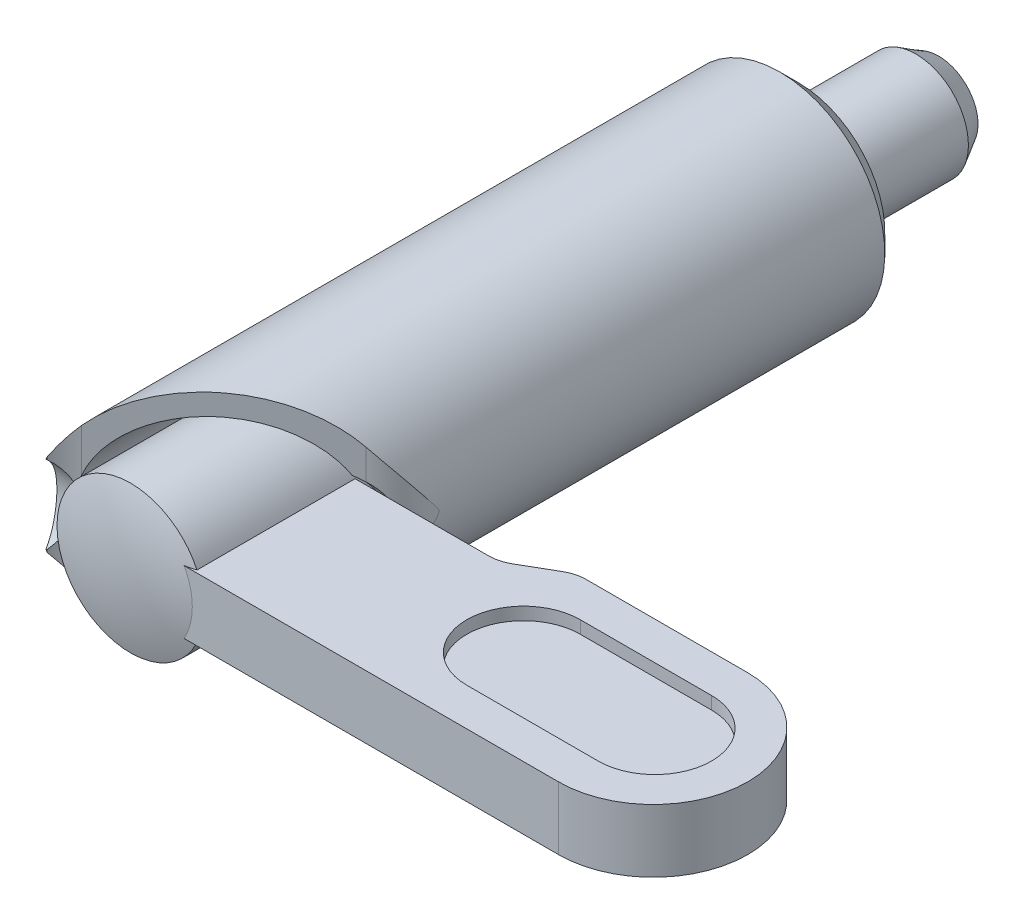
ISO-10303-21;
HEADER;
FILE_DESCRIPTION(('STEP AP214'),'2;1');
FILE_NAME('part.step','',(''),(''),'','','');
FILE_SCHEMA(('AUTOMOTIVE_DESIGN { 1 0 10303 214 1 1 1 1 }'));
ENDSEC;
DATA;
#1=APPLICATION_CONTEXT('core data for automotive mechanical design processes');
#2=APPLICATION_PROTOCOL_DEFINITION('international standard','automotive_design',2000,#1);
#3=PRODUCT_CONTEXT('',#1,'mechanical');
#4=PRODUCT('Part','Part','',(#3));
#5=PRODUCT_RELATED_PRODUCT_CATEGORY('part','',(#4));
#6=PRODUCT_DEFINITION_FORMATION('','',#4);
#7=PRODUCT_DEFINITION_CONTEXT('part definition',#1,'design');
#8=PRODUCT_DEFINITION('design','',#6,#7);
#9=PRODUCT_DEFINITION_SHAPE('','',#8);
#10=(LENGTH_UNIT() NAMED_UNIT(*) SI_UNIT(.MILLI.,.METRE.));
#11=(NAMED_UNIT(*) PLANE_ANGLE_UNIT() SI_UNIT($,.RADIAN.));
#12=(NAMED_UNIT(*) SI_UNIT($,.STERADIAN.) SOLID_ANGLE_UNIT());
#13=UNCERTAINTY_MEASURE_WITH_UNIT(LENGTH_MEASURE(1.E-05),#10,'distance_accuracy_value','');
#14=(GEOMETRIC_REPRESENTATION_CONTEXT(3) GLOBAL_UNCERTAINTY_ASSIGNED_CONTEXT((#13)) GLOBAL_UNIT_ASSIGNED_CONTEXT((#10,
#11,#12)) REPRESENTATION_CONTEXT('',''));
#15=CARTESIAN_POINT('',(0.,0.,0.));
#16=DIRECTION('',(0.,0.,1.));
#17=DIRECTION('',(1.,0.,0.));
#18=AXIS2_PLACEMENT_3D('',#15,#16,#17);
#19=CARTESIAN_POINT('',(-4.5911236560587,24.,36.34284085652));
#20=DIRECTION('',(-0.608367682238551,0.,-0.79365531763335));
#21=DIRECTION('',(0.79365531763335,0.,-0.608367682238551));
#22=AXIS2_PLACEMENT_3D('',#19,#20,#21);
#23=PLANE('',#22);
#24=CARTESIAN_POINT('',(2.07333496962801,0.,31.2342740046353));
#25=DIRECTION('',(-0.608367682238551,0.,-0.79365531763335));
#26=DIRECTION('',(-0.79365531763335,0.,0.608367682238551));
#27=AXIS2_PLACEMENT_3D('',#24,#25,#26);
#28=ELLIPSE('',#27,4.73397927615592,2.88000000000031);
#29=CARTESIAN_POINT('',(4.15973278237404,-2.39512487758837,29.6349688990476));
#30=VERTEX_POINT('',#29);
#31=CARTESIAN_POINT('',(4.5911236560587,-2.13765423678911,29.304291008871));
#32=VERTEX_POINT('',#31);
#33=EDGE_CURVE('E330',#30,#32,#28,.F.);
#34=ORIENTED_EDGE('',*,*,#33,.F.);
#35=CARTESIAN_POINT('',(0.,0.,32.8235659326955));
#36=DIRECTION('',(-0.608367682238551,0.,-0.79365531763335));
#37=DIRECTION('',(0.79365531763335,0.,-0.608367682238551));
#38=AXIS2_PLACEMENT_3D('',#35,#36,#37);
#39=ELLIPSE('',#38,6.04796552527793,4.8);
#40=CARTESIAN_POINT('',(-4.5911236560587,-1.40056544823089,36.34284085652));
#41=VERTEX_POINT('',#40);
#42=EDGE_CURVE('E472',#30,#41,#39,.T.);
#43=ORIENTED_EDGE('',*,*,#42,.T.);
#44=DIRECTION('',(0.,-1.,0.));
#45=VECTOR('',#44,1.);
#46=CARTESIAN_POINT('',(-4.5911236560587,24.,36.34284085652));
#47=LINE('',#46,#45);
#48=CARTESIAN_POINT('',(-4.5911236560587,-3.86284656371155,36.34284085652));
#49=VERTEX_POINT('',#48);
#50=EDGE_CURVE('E474',#41,#49,#47,.T.);
#51=ORIENTED_EDGE('',*,*,#50,.T.);
#52=CARTESIAN_POINT('',(0.,0.,32.8235659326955));
#53=DIRECTION('',(-0.608367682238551,0.,-0.79365531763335));
#54=DIRECTION('',(0.79365531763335,0.,-0.608367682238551));
#55=AXIS2_PLACEMENT_3D('',#52,#53,#54);
#56=ELLIPSE('',#55,7.55995690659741,6.);
#57=CARTESIAN_POINT('',(4.5911236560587,-3.86284656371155,29.304291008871));
#58=VERTEX_POINT('',#57);
#59=EDGE_CURVE('E441',#49,#58,#56,.F.);
#60=ORIENTED_EDGE('',*,*,#59,.T.);
#61=DIRECTION('',(0.,-1.,0.));
#62=VECTOR('',#61,1.);
#63=CARTESIAN_POINT('',(4.5911236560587,24.,29.304291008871));
#64=LINE('',#63,#62);
#65=EDGE_CURVE('E473',#32,#58,#64,.T.);
#66=ORIENTED_EDGE('',*,*,#65,.F.);
#67=EDGE_LOOP('',(#34,#43,#51,#60,#66));
#68=FACE_BOUND('',#67,.T.);
#69=ADVANCED_FACE('F14',(#68),#23,.F.);
#70=CARTESIAN_POINT('',(2.40100000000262,24.,26.4471318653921));
#71=DIRECTION('',(0.,-1.,0.));
#72=DIRECTION('',(1.,0.,0.));
#73=AXIS2_PLACEMENT_3D('',#70,#71,#72);
#74=CYLINDRICAL_SURFACE('',#73,3.59999999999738);
#75=CARTESIAN_POINT('',(4.5911236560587,-2.13765423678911,29.304291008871));
#76=CARTESIAN_POINT('',(4.63745048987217,-2.10561681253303,29.2687958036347));
#77=CARTESIAN_POINT('',(4.68201375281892,-2.07153338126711,29.2328324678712));
#78=CARTESIAN_POINT('',(4.76743931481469,-1.99924944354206,29.1606293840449));
#79=CARTESIAN_POINT('',(4.80830094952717,-1.96104820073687,29.1243895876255));
#80=CARTESIAN_POINT('',(4.88606220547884,-1.88058799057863,29.052371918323));
#81=CARTESIAN_POINT('',(4.92296887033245,-1.8383364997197,29.0165933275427));
#82=CARTESIAN_POINT('',(4.99280621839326,-1.74986126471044,28.9461321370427));
#83=CARTESIAN_POINT('',(5.0257374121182,-1.70363803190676,28.9114493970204));
#84=CARTESIAN_POINT('',(5.11867160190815,-1.55904934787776,28.8099011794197));
#85=CARTESIAN_POINT('',(5.17271007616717,-1.45487423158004,28.7456364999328));
#86=CARTESIAN_POINT('',(5.2654289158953,-1.23397116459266,28.629021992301));
#87=CARTESIAN_POINT('',(5.30411600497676,-1.11724873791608,28.5766669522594));
#88=CARTESIAN_POINT('',(5.36706004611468,-0.876826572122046,28.4880611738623));
#89=CARTESIAN_POINT('',(5.39157168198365,-0.753296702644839,28.4515293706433));
#90=CARTESIAN_POINT('',(5.42858419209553,-0.500693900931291,28.3951766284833));
#91=CARTESIAN_POINT('',(5.44107780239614,-0.37161766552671,28.3753657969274));
#92=CARTESIAN_POINT('',(5.45509745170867,-0.106881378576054,28.3530899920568));
#93=CARTESIAN_POINT('',(5.45623021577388,0.0288521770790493,28.3512470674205));
#94=CARTESIAN_POINT('',(5.44658896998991,0.298810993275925,28.3666282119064));
#95=CARTESIAN_POINT('',(5.43581464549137,0.433036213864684,28.3838527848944));
#96=CARTESIAN_POINT('',(5.40135021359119,0.698002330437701,28.436832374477));
#97=CARTESIAN_POINT('',(5.37748822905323,0.828672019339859,28.4728336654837));
#98=CARTESIAN_POINT('',(5.31526956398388,1.08060295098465,28.5613542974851));
#99=CARTESIAN_POINT('',(5.27691929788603,1.20186832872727,28.6138663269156));
#100=CARTESIAN_POINT('',(5.18534962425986,1.42834249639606,28.7302693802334));
#101=CARTESIAN_POINT('',(5.13253582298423,1.53388275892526,28.7938348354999));
#102=CARTESIAN_POINT('',(5.01077146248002,1.72973848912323,28.928517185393));
#103=CARTESIAN_POINT('',(4.94182836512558,1.82006096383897,28.9996305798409));
#104=CARTESIAN_POINT('',(4.82376514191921,1.94612121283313,29.1104820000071));
#105=CARTESIAN_POINT('',(4.78019017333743,1.98780630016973,29.1495462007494));
#106=CARTESIAN_POINT('',(4.6887986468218,2.06632160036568,29.2273460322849));
#107=CARTESIAN_POINT('',(4.64099024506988,2.10316082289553,29.2660821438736));
#108=CARTESIAN_POINT('',(4.5911236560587,2.13765423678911,29.304291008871));
#109=B_SPLINE_CURVE_WITH_KNOTS('',3,(#75,#76,#77,#78,#79,#80,#81,#82,#83,#84,#85,#86,#87,#88,
#89,#90,#91,#92,#93,#94,#95,#96,#97,#98,#99,#100,#101,#102,#103,#104,#105,#106,#107,#108),
.UNSPECIFIED.,.F.,.F.,(4,2,2,2,2,2,2,2,2,2,2,2,2,2,2,2,4),(0.,0.199685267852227,
0.399406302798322,0.598765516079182,0.798099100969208,1.19730526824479,1.59633639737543,
1.98795576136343,2.37981167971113,2.78518739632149,3.19057382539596,3.60141620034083,
4.01207689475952,4.41222899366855,4.8121963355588,5.0274892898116,5.24237612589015),.UNSPECIFIED.);
#110=CARTESIAN_POINT('',(4.5911236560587,2.13765423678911,29.304291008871));
#111=VERTEX_POINT('',#110);
#112=EDGE_CURVE('E322',#32,#111,#109,.T.);
#113=ORIENTED_EDGE('',*,*,#112,.F.);
#114=ORIENTED_EDGE('',*,*,#65,.T.);
#115=CARTESIAN_POINT('',(0.,6.,29.129518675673));
#116=CARTESIAN_POINT('',(-0.149832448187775,5.99999874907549,28.9953924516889));
#117=CARTESIAN_POINT('',(-0.288439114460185,5.99437295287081,28.8486408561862));
#118=CARTESIAN_POINT('',(-0.539144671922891,5.97705575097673,28.5342514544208));
#119=CARTESIAN_POINT('',(-0.651220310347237,5.96535905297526,28.3665955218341));
#120=CARTESIAN_POINT('',(-0.845744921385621,5.9409037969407,28.0152228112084));
#121=CARTESIAN_POINT('',(-0.92822854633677,5.92814650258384,27.8315251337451));
#122=CARTESIAN_POINT('',(-1.06148614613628,5.9057469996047,27.4528456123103));
#123=CARTESIAN_POINT('',(-1.11227176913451,5.89610364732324,27.257867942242));
#124=CARTESIAN_POINT('',(-1.18087874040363,5.88275288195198,26.8606673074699));
#125=CARTESIAN_POINT('',(-1.19848460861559,5.87908429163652,26.6584056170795));
#126=CARTESIAN_POINT('',(-1.19949304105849,5.87887910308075,26.2537981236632));
#127=CARTESIAN_POINT('',(-1.18289653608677,5.88234231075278,26.051452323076));
#128=CARTESIAN_POINT('',(-1.11665208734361,5.89526686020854,25.6562111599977));
#129=CARTESIAN_POINT('',(-1.0676026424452,5.90461944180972,25.4632113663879));
#130=CARTESIAN_POINT('',(-0.938510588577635,5.92650517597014,25.0880640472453));
#131=CARTESIAN_POINT('',(-0.858460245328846,5.93903912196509,24.9059192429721));
#132=CARTESIAN_POINT('',(-0.6677661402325,5.96350824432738,24.554169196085));
#133=CARTESIAN_POINT('',(-0.556625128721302,5.97542960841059,24.3848299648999));
#134=CARTESIAN_POINT('',(-0.369835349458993,5.98891620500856,24.1465426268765));
#135=CARTESIAN_POINT('',(-0.304183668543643,5.99268002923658,24.0696954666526));
#136=CARTESIAN_POINT('',(-0.166621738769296,5.99808067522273,23.9217605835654));
#137=CARTESIAN_POINT('',(-0.0947142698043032,5.99971843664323,23.8506703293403));
#138=CARTESIAN_POINT('',(0.0541657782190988,6.00021307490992,23.7153925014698));
#139=CARTESIAN_POINT('',(0.131087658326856,5.99909453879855,23.6511491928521));
#140=CARTESIAN_POINT('',(0.289912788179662,5.99351813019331,23.529372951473));
#141=CARTESIAN_POINT('',(0.371813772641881,5.98906176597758,23.4718370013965));
#142=CARTESIAN_POINT('',(0.539871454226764,5.97625603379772,23.363924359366));
#143=CARTESIAN_POINT('',(0.626026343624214,5.96790830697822,23.313544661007));
#144=CARTESIAN_POINT('',(0.801797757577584,5.94684382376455,23.2202995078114));
#145=CARTESIAN_POINT('',(0.891414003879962,5.93412741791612,23.1774334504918));
#146=CARTESIAN_POINT('',(1.06636624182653,5.90509317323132,23.102416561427));
#147=CARTESIAN_POINT('',(1.15151820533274,5.88911754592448,23.0697027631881));
#148=CARTESIAN_POINT('',(1.32327085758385,5.8529188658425,23.0110384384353));
#149=CARTESIAN_POINT('',(1.40987201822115,5.83269440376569,22.9850901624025));
#150=CARTESIAN_POINT('',(1.58367432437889,5.78792005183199,22.9399917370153));
#151=CARTESIAN_POINT('',(1.67087513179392,5.7633724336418,22.9208380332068));
#152=CARTESIAN_POINT('',(1.84517572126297,5.70996127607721,22.8891942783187));
#153=CARTESIAN_POINT('',(1.93227545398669,5.68109614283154,22.8767066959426));
#154=CARTESIAN_POINT('',(2.18731820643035,5.58994387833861,22.8495032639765));
#155=CARTESIAN_POINT('',(2.35420963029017,5.52176616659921,22.8437481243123));
#156=CARTESIAN_POINT('',(2.68050208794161,5.37096893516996,22.8542773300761));
#157=CARTESIAN_POINT('',(2.83989961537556,5.28834273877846,22.8705718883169));
#158=CARTESIAN_POINT('',(3.09987658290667,5.13864828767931,22.9139901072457));
#159=CARTESIAN_POINT('',(3.203225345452,5.07482700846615,22.9361152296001));
#160=CARTESIAN_POINT('',(3.4045032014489,4.94205491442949,22.9882600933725));
#161=CARTESIAN_POINT('',(3.50243067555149,4.87310258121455,23.0182821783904));
#162=CARTESIAN_POINT('',(3.78773583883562,4.65934396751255,23.118821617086));
#163=CARTESIAN_POINT('',(3.96647443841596,4.50773047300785,23.1997823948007));
#164=CARTESIAN_POINT('',(4.24760325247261,4.2406366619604,23.3540415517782));
#165=CARTESIAN_POINT('',(4.35645642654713,4.12857246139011,23.421900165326));
#166=CARTESIAN_POINT('',(4.5628044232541,3.89930309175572,23.5657432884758));
#167=CARTESIAN_POINT('',(4.66029971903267,3.78209813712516,23.6417274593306));
#168=CARTESIAN_POINT('',(4.84433427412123,3.54333241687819,23.8004510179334));
#169=CARTESIAN_POINT('',(4.93085216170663,3.42176372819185,23.8832030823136));
#170=CARTESIAN_POINT('',(5.09306925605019,3.1752810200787,24.054092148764));
#171=CARTESIAN_POINT('',(5.16876847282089,3.05036700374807,24.1422291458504));
#172=CARTESIAN_POINT('',(5.3366456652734,2.74957527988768,24.3573801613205));
#173=CARTESIAN_POINT('',(5.42407153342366,2.57245810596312,24.4863834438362));
#174=CARTESIAN_POINT('',(5.57983611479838,2.21440062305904,24.7505121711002));
#175=CARTESIAN_POINT('',(5.64816670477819,2.0334587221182,24.8856401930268));
#176=CARTESIAN_POINT('',(5.76633378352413,1.6691320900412,25.1599681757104));
#177=CARTESIAN_POINT('',(5.81619852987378,1.48575153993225,25.2991615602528));
#178=CARTESIAN_POINT('',(5.89810195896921,1.11716298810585,25.5801327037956));
#179=CARTESIAN_POINT('',(5.9301467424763,0.931955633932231,25.7219095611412));
#180=CARTESIAN_POINT('',(5.96809941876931,0.629009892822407,25.9532455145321));
#181=CARTESIAN_POINT('',(5.97929612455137,0.51181430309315,26.0426012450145));
#182=CARTESIAN_POINT('',(5.99143073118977,0.327430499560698,26.180185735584));
#183=CARTESIAN_POINT('',(5.99471452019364,0.260889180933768,26.2292385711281));
#184=CARTESIAN_POINT('',(5.99801450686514,0.158149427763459,26.2988860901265));
#185=CARTESIAN_POINT('',(5.99884343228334,0.123563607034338,26.3213618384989));
#186=CARTESIAN_POINT('',(5.99951208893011,0.077068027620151,26.3435208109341));
#187=CARTESIAN_POINT('',(5.99962851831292,0.0674813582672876,26.3477021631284));
#188=CARTESIAN_POINT('',(5.99981716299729,0.0478587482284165,26.3547916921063));
#189=CARTESIAN_POINT('',(5.99988955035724,0.037824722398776,26.3577048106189));
#190=CARTESIAN_POINT('',(5.99997491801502,0.0192411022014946,26.3612106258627));
#191=CARTESIAN_POINT('',(5.99999637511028,0.0107578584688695,26.3621315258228));
#192=CARTESIAN_POINT('',(6.00000276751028,-0.00622162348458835,26.3624019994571));
#193=CARTESIAN_POINT('',(5.9999877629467,-0.0147178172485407,26.3617541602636));
#194=CARTESIAN_POINT('',(5.9999111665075,-0.0346381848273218,26.3585817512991));
#195=CARTESIAN_POINT('',(5.99983413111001,-0.0459573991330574,26.3554412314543));
#196=CARTESIAN_POINT('',(5.9996241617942,-0.068063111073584,26.3475265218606));
#197=CARTESIAN_POINT('',(5.99949073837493,-0.0788439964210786,26.342738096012));
#198=CARTESIAN_POINT('',(5.99863119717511,-0.136706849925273,26.3146807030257));
#199=CARTESIAN_POINT('',(5.99745196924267,-0.180288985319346,26.2848083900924));
#200=CARTESIAN_POINT('',(5.99422904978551,-0.26646140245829,26.2241146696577));
#201=CARTESIAN_POINT('',(5.99218298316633,-0.309048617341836,26.1932908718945));
#202=CARTESIAN_POINT('',(5.98477662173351,-0.435427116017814,26.1003101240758));
#203=CARTESIAN_POINT('',(5.97813608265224,-0.518537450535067,26.0371600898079));
#204=CARTESIAN_POINT('',(5.96141631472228,-0.684412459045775,25.9108764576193));
#205=CARTESIAN_POINT('',(5.95133464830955,-0.767176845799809,25.8477429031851));
#206=CARTESIAN_POINT('',(5.92772444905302,-0.932221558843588,25.7216681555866));
#207=CARTESIAN_POINT('',(5.91420031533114,-1.01450236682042,25.6587268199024));
#208=CARTESIAN_POINT('',(5.88367334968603,-1.17870920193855,25.5332585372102));
#209=CARTESIAN_POINT('',(5.86667081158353,-1.2606352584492,25.4707315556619));
#210=CARTESIAN_POINT('',(5.80993608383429,-1.50780030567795,25.2824560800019));
#211=CARTESIAN_POINT('',(5.76475584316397,-1.67245541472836,25.1575258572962));
#212=CARTESIAN_POINT('',(5.65958701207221,-1.99965437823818,24.9110388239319));
#213=CARTESIAN_POINT('',(5.59959235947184,-2.16219733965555,24.7894834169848));
#214=CARTESIAN_POINT('',(5.46423214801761,-2.48449904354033,24.550971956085));
#215=CARTESIAN_POINT('',(5.38885494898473,-2.64425557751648,24.4340194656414));
#216=CARTESIAN_POINT('',(5.2221981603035,-2.95981008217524,24.2064339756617));
#217=CARTESIAN_POINT('',(5.1309252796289,-3.11560969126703,24.095798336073));
#218=CARTESIAN_POINT('',(4.88918979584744,-3.48767674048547,23.8370972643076));
#219=CARTESIAN_POINT('',(4.73009050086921,-3.70137409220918,23.693208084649));
#220=CARTESIAN_POINT('',(4.37637008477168,-4.11350760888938,23.4294337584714));
#221=CARTESIAN_POINT('',(4.18180689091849,-4.3119679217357,23.3095101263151));
#222=CARTESIAN_POINT('',(3.8042285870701,-4.64500508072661,23.1268289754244));
#223=CARTESIAN_POINT('',(3.62843167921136,-4.78391974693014,23.0572816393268));
#224=CARTESIAN_POINT('',(3.3497078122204,-4.97919285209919,22.9730307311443));
#225=CARTESIAN_POINT('',(3.25430901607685,-5.04209312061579,22.9482940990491));
#226=CARTESIAN_POINT('',(3.0588471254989,-5.1630065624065,22.9063384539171));
#227=CARTESIAN_POINT('',(2.95878489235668,-5.22102063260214,22.889118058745));
#228=CARTESIAN_POINT('',(2.77263765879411,-5.32180685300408,22.8653626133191));
#229=CARTESIAN_POINT('',(2.68720092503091,-5.36546240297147,22.8574784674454));
#230=CARTESIAN_POINT('',(2.51405132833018,-5.44874006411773,22.8478633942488));
#231=CARTESIAN_POINT('',(2.42633892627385,-5.48836298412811,22.8461312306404));
#232=CARTESIAN_POINT('',(2.24920986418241,-5.56329949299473,22.8492429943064));
#233=CARTESIAN_POINT('',(2.15979339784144,-5.59861356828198,22.8540861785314));
#234=CARTESIAN_POINT('',(1.97997253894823,-5.66470468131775,22.8706973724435));
#235=CARTESIAN_POINT('',(1.88956862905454,-5.69548383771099,22.8824621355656));
#236=CARTESIAN_POINT('',(1.70806811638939,-5.7525295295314,22.9132447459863));
#237=CARTESIAN_POINT('',(1.61697028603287,-5.77877331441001,22.9322977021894));
#238=CARTESIAN_POINT('',(1.43541422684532,-5.82652499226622,22.9777806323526));
#239=CARTESIAN_POINT('',(1.34495576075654,-5.84803474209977,23.0042077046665));
#240=CARTESIAN_POINT('',(1.16550873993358,-5.88642596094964,23.0644523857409));
#241=CARTESIAN_POINT('',(1.07652048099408,-5.90330650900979,23.0982714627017));
#242=CARTESIAN_POINT('',(0.900907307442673,-5.93264631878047,23.1731687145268));
#243=CARTESIAN_POINT('',(0.814282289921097,-5.94510577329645,23.214246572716));
#244=CARTESIAN_POINT('',(0.650366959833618,-5.96517721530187,23.30019439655));
#245=CARTESIAN_POINT('',(0.572854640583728,-5.97307462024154,23.3445752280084));
#246=CARTESIAN_POINT('',(0.421151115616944,-5.98568587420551,23.4391091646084));
#247=CARTESIAN_POINT('',(0.346961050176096,-5.99039863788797,23.4892642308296));
#248=CARTESIAN_POINT('',(0.130246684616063,-6.0003246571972,23.6479080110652));
#249=CARTESIAN_POINT('',(-0.00655897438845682,-6.00134094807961,23.7646472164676));
#250=CARTESIAN_POINT('',(-0.266493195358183,-5.99555354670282,24.0223757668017));
#251=CARTESIAN_POINT('',(-0.388795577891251,-5.98841635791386,24.1641836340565));
#252=CARTESIAN_POINT('',(-0.609895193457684,-5.96995379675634,24.4648735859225));
#253=CARTESIAN_POINT('',(-0.708683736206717,-5.95862687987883,24.6237619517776));
#254=CARTESIAN_POINT('',(-0.88667509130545,-5.93485349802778,24.9668706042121));
#255=CARTESIAN_POINT('',(-0.96395345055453,-5.92238517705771,25.1520912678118));
#256=CARTESIAN_POINT('',(-1.08674405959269,-5.90109314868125,25.5329787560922));
#257=CARTESIAN_POINT('',(-1.1322576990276,-5.89226928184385,25.7286451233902));
#258=CARTESIAN_POINT('',(-1.19038085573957,-5.88080808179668,26.1266153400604));
#259=CARTESIAN_POINT('',(-1.20272407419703,-5.87822083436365,26.3289597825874));
#260=CARTESIAN_POINT('',(-1.19332722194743,-5.88013526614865,26.7328077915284));
#261=CARTESIAN_POINT('',(-1.17158865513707,-5.88463663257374,26.9343113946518));
#262=CARTESIAN_POINT('',(-1.09537171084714,-5.89928853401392,27.3273623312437));
#263=CARTESIAN_POINT('',(-1.04143432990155,-5.90934552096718,27.5190185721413));
#264=CARTESIAN_POINT('',(-0.902851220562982,-5.9320966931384,27.8907235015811));
#265=CARTESIAN_POINT('',(-0.818197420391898,-5.94479157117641,28.0707691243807));
#266=CARTESIAN_POINT('',(-0.618435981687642,-5.96890163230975,28.4178602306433));
#267=CARTESIAN_POINT('',(-0.502791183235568,-5.98028862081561,28.5846016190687));
#268=CARTESIAN_POINT('',(-0.30958499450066,-5.99235538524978,28.8184195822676));
#269=CARTESIAN_POINT('',(-0.241851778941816,-5.9955423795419,28.8936789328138));
#270=CARTESIAN_POINT('',(-0.100264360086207,-5.99957981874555,29.0382498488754));
#271=CARTESIAN_POINT('',(-0.0264129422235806,-6.00043132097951,29.1075640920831));
#272=CARTESIAN_POINT('',(0.125730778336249,-5.99915772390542,29.2387435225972));
#273=CARTESIAN_POINT('',(0.20394236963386,-5.99707596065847,29.3007027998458));
#274=CARTESIAN_POINT('',(0.365095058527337,-5.98942463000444,29.4178229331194));
#275=CARTESIAN_POINT('',(0.44803398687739,-5.98385665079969,29.472986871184));
#276=CARTESIAN_POINT('',(0.617893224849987,-5.96870789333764,29.57609287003));
#277=CARTESIAN_POINT('',(0.704811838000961,-5.95912881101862,29.62403797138));
#278=CARTESIAN_POINT('',(0.881819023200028,-5.93551714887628,29.7123838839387));
#279=CARTESIAN_POINT('',(0.97190734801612,-5.92148491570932,29.7527852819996));
#280=CARTESIAN_POINT('',(1.14734009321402,-5.8899011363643,29.823012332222));
#281=CARTESIAN_POINT('',(1.23251910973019,-5.87270162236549,29.8534111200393));
#282=CARTESIAN_POINT('',(1.40406808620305,-5.83406599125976,29.9075102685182));
#283=CARTESIAN_POINT('',(1.49043843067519,-5.81262847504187,29.9312084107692));
#284=CARTESIAN_POINT('',(1.66354190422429,-5.76547189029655,29.9719090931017));
#285=CARTESIAN_POINT('',(1.75027484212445,-5.73975485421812,29.9889147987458));
#286=CARTESIAN_POINT('',(1.9234247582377,-5.68407686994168,30.0163923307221));
#287=CARTESIAN_POINT('',(2.00984160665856,-5.65411434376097,30.0268617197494));
#288=CARTESIAN_POINT('',(2.26411449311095,-5.55931138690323,30.0484845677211));
#289=CARTESIAN_POINT('',(2.43062987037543,-5.48856961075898,30.0506736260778));
#290=CARTESIAN_POINT('',(2.75557372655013,-5.33285785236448,30.0333319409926));
#291=CARTESIAN_POINT('',(2.91399832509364,-5.24788112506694,30.0137908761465));
#292=CARTESIAN_POINT('',(3.17365852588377,-5.09345888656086,29.9649136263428));
#293=CARTESIAN_POINT('',(3.27768675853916,-5.02710054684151,29.9403342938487));
#294=CARTESIAN_POINT('',(3.48000175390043,-4.88923173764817,29.8832354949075));
#295=CARTESIAN_POINT('',(3.57828670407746,-4.81771965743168,29.8507135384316));
#296=CARTESIAN_POINT('',(3.86424231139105,-4.59627248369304,29.7426554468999));
#297=CARTESIAN_POINT('',(4.04283656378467,-4.43953326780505,29.6566635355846));
#298=CARTESIAN_POINT('',(4.32336710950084,-4.16347151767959,29.4937905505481));
#299=CARTESIAN_POINT('',(4.43196312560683,-4.04750907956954,29.4222723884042));
#300=CARTESIAN_POINT('',(4.63737065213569,-3.81042861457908,29.2711173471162));
#301=CARTESIAN_POINT('',(4.73417778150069,-3.68930869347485,29.1914774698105));
#302=CARTESIAN_POINT('',(4.91638341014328,-3.44277857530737,29.0255162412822));
#303=CARTESIAN_POINT('',(5.00176212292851,-3.31736139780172,28.9391837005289));
#304=CARTESIAN_POINT('',(5.16130324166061,-3.06324220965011,28.7612196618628));
#305=CARTESIAN_POINT('',(5.23546589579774,-2.93454027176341,28.6695882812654));
#306=CARTESIAN_POINT('',(5.39869978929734,-2.62581530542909,28.4469667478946));
#307=CARTESIAN_POINT('',(5.48296490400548,-2.44460976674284,28.314079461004));
#308=CARTESIAN_POINT('',(5.63194617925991,-2.07852538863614,28.042431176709));
#309=CARTESIAN_POINT('',(5.69665236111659,-1.89364472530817,27.9036672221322));
#310=CARTESIAN_POINT('',(5.80709812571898,-1.52157487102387,27.6224286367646));
#311=CARTESIAN_POINT('',(5.85286585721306,-1.33438953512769,27.4799598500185));
#312=CARTESIAN_POINT('',(5.9260594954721,-0.958407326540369,27.1926494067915));
#313=CARTESIAN_POINT('',(5.95349883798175,-0.76961173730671,27.0478095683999));
#314=CARTESIAN_POINT('',(5.98118235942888,-0.484365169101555,26.8313649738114));
#315=CARTESIAN_POINT('',(5.98816456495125,-0.388810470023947,26.7592559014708));
#316=CARTESIAN_POINT('',(5.99531872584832,-0.242256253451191,26.6523463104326));
#317=CARTESIAN_POINT('',(5.99715131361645,-0.192252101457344,26.616499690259));
#318=CARTESIAN_POINT('',(5.99868328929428,-0.126376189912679,26.5765436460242));
#319=CARTESIAN_POINT('',(5.99895427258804,-0.11286353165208,26.5687041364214));
#320=CARTESIAN_POINT('',(5.9994120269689,-0.0851418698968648,26.5542779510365));
#321=CARTESIAN_POINT('',(5.99959886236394,-0.070933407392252,26.5476903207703));
#322=CARTESIAN_POINT('',(5.99981804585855,-0.0475204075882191,26.5394292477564));
#323=CARTESIAN_POINT('',(5.99988232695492,-0.0386539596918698,26.5368484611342));
#324=CARTESIAN_POINT('',(5.99997111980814,-0.020652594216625,26.5332156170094));
#325=CARTESIAN_POINT('',(5.9999959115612,-0.0115200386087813,26.5321528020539));
#326=CARTESIAN_POINT('',(6.00000317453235,0.00683625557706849,26.5318435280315));
#327=CARTESIAN_POINT('',(5.99998538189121,0.0160602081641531,26.5326083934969));
#328=CARTESIAN_POINT('',(5.99990908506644,0.0342665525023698,26.5357680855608));
#329=CARTESIAN_POINT('',(5.99985029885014,0.0432468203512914,26.5381742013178));
#330=CARTESIAN_POINT('',(5.99951121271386,0.082487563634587,26.5510746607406));
#331=CARTESIAN_POINT('',(5.99904173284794,0.110754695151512,26.5669055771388));
#332=CARTESIAN_POINT('',(5.99776635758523,0.166003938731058,26.6007398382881));
#333=CARTESIAN_POINT('',(5.99695566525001,0.192961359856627,26.6187714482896));
#334=CARTESIAN_POINT('',(5.99406846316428,0.271788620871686,26.6732505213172));
#335=CARTESIAN_POINT('',(5.9915217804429,0.322929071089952,26.710879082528));
#336=CARTESIAN_POINT('',(5.98516274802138,0.424752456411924,26.7866275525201));
#337=CARTESIAN_POINT('',(5.98134884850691,0.475434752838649,26.8247480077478));
#338=CARTESIAN_POINT('',(5.9724902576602,0.576102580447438,26.9008987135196));
#339=CARTESIAN_POINT('',(5.96745642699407,0.626090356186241,26.9389269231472));
#340=CARTESIAN_POINT('',(5.95614038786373,0.725885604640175,27.0149871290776));
#341=CARTESIAN_POINT('',(5.94985856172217,0.775693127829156,27.0530191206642));
#342=CARTESIAN_POINT('',(5.91505646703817,1.02627655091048,27.2444429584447));
#343=CARTESIAN_POINT('',(5.87693607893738,1.2261651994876,27.397411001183));
#344=CARTESIAN_POINT('',(5.77974607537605,1.62370517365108,27.699880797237));
#345=CARTESIAN_POINT('',(5.72065862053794,1.82135444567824,27.8493794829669));
#346=CARTESIAN_POINT('',(5.58056101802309,2.21379550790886,28.1432942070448));
#347=CARTESIAN_POINT('',(5.49948026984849,2.40857592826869,28.2876921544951));
#348=CARTESIAN_POINT('',(5.31458057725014,2.79297076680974,28.5682788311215));
#349=CARTESIAN_POINT('',(5.21078039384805,2.98258930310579,28.7044742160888));
#350=CARTESIAN_POINT('',(4.95922281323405,3.38706255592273,28.9882739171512));
#351=CARTESIAN_POINT('',(4.80697263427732,3.6006337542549,29.1337985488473));
#352=CARTESIAN_POINT('',(4.46796155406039,4.01353700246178,29.4025268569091));
#353=CARTESIAN_POINT('',(4.2812766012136,4.21289907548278,29.5257784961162));
#354=CARTESIAN_POINT('',(3.91145736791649,4.55534058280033,29.7202510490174));
#355=CARTESIAN_POINT('',(3.7344957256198,4.70188518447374,29.7969163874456));
#356=CARTESIAN_POINT('',(3.45268047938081,4.90842118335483,29.891517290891));
#357=CARTESIAN_POINT('',(3.35602022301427,4.9750490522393,29.9196502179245));
#358=CARTESIAN_POINT('',(3.15755877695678,5.10330838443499,29.9682175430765));
#359=CARTESIAN_POINT('',(3.0557586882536,5.16494091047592,29.9886535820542));
#360=CARTESIAN_POINT('',(2.86777297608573,5.27116485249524,30.0177533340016));
#361=CARTESIAN_POINT('',(2.78237787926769,5.3167459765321,30.0279298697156));
#362=CARTESIAN_POINT('',(2.60907509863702,5.40389928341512,30.0421644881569));
#363=CARTESIAN_POINT('',(2.52116795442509,5.44547231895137,30.046223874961));
#364=CARTESIAN_POINT('',(2.34338860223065,5.5243084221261,30.0477680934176));
#365=CARTESIAN_POINT('',(2.25351662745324,5.56157199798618,30.0452537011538));
#366=CARTESIAN_POINT('',(2.07250812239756,5.6315289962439,30.0332599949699));
#367=CARTESIAN_POINT('',(1.98137221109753,5.66422457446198,30.0237839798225));
#368=CARTESIAN_POINT('',(1.7980530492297,5.72506622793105,29.9974946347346));
#369=CARTESIAN_POINT('',(1.70586679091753,5.75318566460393,29.9806403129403));
#370=CARTESIAN_POINT('',(1.52186401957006,5.80457163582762,29.9394099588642));
#371=CARTESIAN_POINT('',(1.43004737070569,5.82784015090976,29.9150370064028));
#372=CARTESIAN_POINT('',(1.24766028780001,5.86959040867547,29.8587166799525));
#373=CARTESIAN_POINT('',(1.15708973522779,5.88807260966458,29.8267700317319));
#374=CARTESIAN_POINT('',(0.978127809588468,5.92043474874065,29.7554135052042));
#375=CARTESIAN_POINT('',(0.889736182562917,5.93431522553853,29.7160045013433));
#376=CARTESIAN_POINT('',(0.65840937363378,5.96554040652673,29.601381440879));
#377=CARTESIAN_POINT('',(0.518081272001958,5.97910068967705,29.5197293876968));
#378=CARTESIAN_POINT('',(0.24939235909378,5.99633183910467,29.3379726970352));
#379=CARTESIAN_POINT('',(0.121033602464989,6.00000101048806,29.2378649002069));
#380=CARTESIAN_POINT('',(0.,6.,29.129518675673));
#381=B_SPLINE_CURVE_WITH_KNOTS('',3,(#115,#116,#117,#118,#119,#120,#121,#122,#123,#124,#125,
#126,#127,#128,#129,#130,#131,#132,#133,#134,#135,#136,#137,#138,#139,#140,#141,#142,#143,#144,
#145,#146,#147,#148,#149,#150,#151,#152,#153,#154,#155,#156,#157,#158,#159,#160,#161,#162,#163,
#164,#165,#166,#167,#168,#169,#170,#171,#172,#173,#174,#175,#176,#177,#178,#179,#180,#181,#182,
#183,#184,#185,#186,#187,#188,#189,#190,#191,#192,#193,#194,#195,#196,#197,#198,#199,#200,#201,
#202,#203,#204,#205,#206,#207,#208,#209,#210,#211,#212,#213,#214,#215,#216,#217,#218,#219,#220,
#221,#222,#223,#224,#225,#226,#227,#228,#229,#230,#231,#232,#233,#234,#235,#236,#237,#238,#239,
#240,#241,#242,#243,#244,#245,#246,#247,#248,#249,#250,#251,#252,#253,#254,#255,#256,#257,#258,
#259,#260,#261,#262,#263,#264,#265,#266,#267,#268,#269,#270,#271,#272,#273,#274,#275,#276,#277,
#278,#279,#280,#281,#282,#283,#284,#285,#286,#287,#288,#289,#290,#291,#292,#293,#294,#295,#296,
#297,#298,#299,#300,#301,#302,#303,#304,#305,#306,#307,#308,#309,#310,#311,#312,#313,#314,#315,
#316,#317,#318,#319,#320,#321,#322,#323,#324,#325,#326,#327,#328,#329,#330,#331,#332,#333,#334,
#335,#336,#337,#338,#339,#340,#341,#342,#343,#344,#345,#346,#347,#348,#349,#350,#351,#352,#353,
#354,#355,#356,#357,#358,#359,#360,#361,#362,#363,#364,#365,#366,#367,#368,#369,#370,#371,#372,
#373,#374,#375,#376,#377,#378,#379,#380),.UNSPECIFIED.,.T.,.F.,(4,2,2,2,2,2,2,2,2,2,2,2,2,2,2,2,
2,2,2,2,2,2,2,2,2,2,2,2,2,2,2,2,2,2,2,2,2,2,2,2,2,2,2,2,2,2,2,2,2,2,2,2,2,2,2,2,2,2,2,2,2,2,2,2,
2,2,2,2,2,2,2,2,2,2,2,2,2,2,2,2,2,2,2,2,2,2,2,2,2,2,2,2,2,2,2,2,2,2,2,2,2,2,2,2,2,2,2,2,2,2,2,2,
2,2,2,2,2,2,2,2,2,2,2,2,2,2,2,2,2,2,2,2,4),(0.,0.602685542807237,1.2058973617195,
1.80840049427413,2.4106820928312,3.01686180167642,3.6230250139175,4.21830979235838,
4.81374318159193,5.4193052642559,5.72242314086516,6.02540700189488,6.32569795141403,
6.62585328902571,6.92588215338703,7.22588694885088,7.50336011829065,7.78092546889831,
8.05834540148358,8.33586800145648,8.87453926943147,9.41346012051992,9.78337426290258,
10.1533983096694,10.8940083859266,11.4044246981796,11.9148197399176,12.4261936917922,
12.9375671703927,13.644293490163,14.35131999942,15.0572600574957,15.7629582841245,
16.2060212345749,16.4544616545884,16.5776687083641,16.60899794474,16.6402039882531,
16.6656713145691,16.6910966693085,16.7261165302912,16.7614468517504,16.9190543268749,
17.0770964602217,17.3906165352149,17.7043591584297,18.0177028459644,18.3310200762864,
18.9651393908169,19.599518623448,20.2343796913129,20.8689734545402,21.7743906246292,
22.6783419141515,23.379299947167,23.7296842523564,24.0800040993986,24.368523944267,
24.6569858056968,24.9454150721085,25.233709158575,25.5234098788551,25.8129967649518,
26.1026412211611,26.3922730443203,26.6609573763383,26.9297332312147,27.4668235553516,
28.0266934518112,28.5867699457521,29.1872077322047,29.7876192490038,30.3928367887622,
30.9980276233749,31.5933255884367,32.1887801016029,32.7953101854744,33.0988986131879,
33.402349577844,33.7013640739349,34.0002424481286,34.29899458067,34.5977234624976,
34.8735635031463,35.1494947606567,35.4252953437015,35.7011987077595,36.2415785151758,
36.7822151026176,37.1591666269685,37.5362364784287,38.2909984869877,38.813095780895,
39.3353865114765,39.858570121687,40.3817421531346,41.1006883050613,41.8200006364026,
42.5382399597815,43.2559521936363,43.6157805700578,43.8001419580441,43.8469982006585,
43.8938185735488,43.9214337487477,43.9488522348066,43.976441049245,44.0042215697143,
44.1003393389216,44.1978560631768,44.3882618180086,44.5789013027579,44.7679022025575,
44.9568452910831,45.7195898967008,46.482985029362,47.248860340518,48.0141055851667,
48.9112493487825,49.8064375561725,50.530112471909,50.8919019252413,51.2536142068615,
51.5453305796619,51.8369847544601,52.128604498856,52.4200861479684,52.7132081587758,
53.0062102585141,53.2991842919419,53.5921240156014,54.0788857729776,54.5657309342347),.UNSPECIFIED.);
#382=CARTESIAN_POINT('',(4.5911236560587,3.86284656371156,29.304291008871));
#383=VERTEX_POINT('',#382);
#384=EDGE_CURVE('E437',#58,#383,#381,.T.);
#385=ORIENTED_EDGE('',*,*,#384,.T.);
#386=EDGE_CURVE('E476',#383,#111,#64,.T.);
#387=ORIENTED_EDGE('',*,*,#386,.T.);
#388=EDGE_LOOP('',(#113,#114,#385,#387));
#389=FACE_BOUND('',#388,.T.);
#390=ADVANCED_FACE('F332',(#389),#74,.T.);
#391=CARTESIAN_POINT('',(2.07333496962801,0.,31.2342740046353));
#392=DIRECTION('',(-0.608367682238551,0.,-0.79365531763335));
#393=DIRECTION('',(-0.79365531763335,0.,0.608367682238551));
#394=AXIS2_PLACEMENT_3D('',#391,#392,#393);
#395=ELLIPSE('',#394,4.73397927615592,2.88000000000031);
#396=CARTESIAN_POINT('',(4.15973278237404,2.39512487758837,29.6349688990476));
#397=VERTEX_POINT('',#396);
#398=EDGE_CURVE('E320',#111,#397,#395,.F.);
#399=ORIENTED_EDGE('',*,*,#398,.F.);
#400=ORIENTED_EDGE('',*,*,#386,.F.);
#401=CARTESIAN_POINT('',(-4.5911236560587,3.86284656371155,36.34284085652));
#402=VERTEX_POINT('',#401);
#403=EDGE_CURVE('E442',#383,#402,#56,.F.);
#404=ORIENTED_EDGE('',*,*,#403,.T.);
#405=CARTESIAN_POINT('',(-4.5911236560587,1.40056544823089,36.34284085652));
#406=VERTEX_POINT('',#405);
#407=EDGE_CURVE('E464',#402,#406,#47,.T.);
#408=ORIENTED_EDGE('',*,*,#407,.T.);
#409=EDGE_CURVE('E469',#406,#397,#39,.T.);
#410=ORIENTED_EDGE('',*,*,#409,.T.);
#411=EDGE_LOOP('',(#399,#400,#404,#408,#410));
#412=FACE_BOUND('',#411,.T.);
#413=ADVANCED_FACE('F368',(#412),#23,.F.);
#414=CARTESIAN_POINT('',(0.,0.,25.));
#415=DIRECTION('',(0.,0.,-1.));
#416=DIRECTION('',(0.,1.,0.));
#417=AXIS2_PLACEMENT_3D('',#414,#415,#416);
#418=CYLINDRICAL_SURFACE('',#417,4.8);
#419=CARTESIAN_POINT('',(0.,0.,25.));
#420=DIRECTION('',(0.,0.,-1.));
#421=DIRECTION('',(0.,1.,0.));
#422=AXIS2_PLACEMENT_3D('',#419,#420,#421);
#423=CIRCLE('',#422,4.8);
#424=CARTESIAN_POINT('',(0.,4.8,25.));
#425=VERTEX_POINT('',#424);
#426=EDGE_CURVE('E425',#425,#425,#423,.T.);
#427=ORIENTED_EDGE('',*,*,#426,.T.);
#428=EDGE_LOOP('',(#427));
#429=FACE_BOUND('',#428,.T.);
#430=CARTESIAN_POINT('',(4.08529068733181,2.52,29.84));
#431=CARTESIAN_POINT('',(4.11055424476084,2.47904692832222,29.766002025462));
#432=CARTESIAN_POINT('',(4.136853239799,2.43503125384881,29.6941226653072));
#433=CARTESIAN_POINT('',(4.19070754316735,2.34113158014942,29.554818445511));
#434=CARTESIAN_POINT('',(4.21826266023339,2.29124847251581,29.4873929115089));
#435=CARTESIAN_POINT('',(4.30180175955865,2.1327858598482,29.2916240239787));
#436=CARTESIAN_POINT('',(4.35846706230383,2.01568964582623,29.1703211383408));
#437=CARTESIAN_POINT('',(4.46750804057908,1.76083831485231,28.9490388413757));
#438=CARTESIAN_POINT('',(4.51988099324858,1.62307023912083,28.8490729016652));
#439=CARTESIAN_POINT('',(4.59097729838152,1.40317148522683,28.7177675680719));
#440=CARTESIAN_POINT('',(4.6134279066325,1.32768301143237,28.6771135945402));
#441=CARTESIAN_POINT('',(4.65523470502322,1.17269564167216,28.6024358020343));
#442=CARTESIAN_POINT('',(4.67459265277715,1.09319905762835,28.5684082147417));
#443=CARTESIAN_POINT('',(4.70855602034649,0.935728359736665,28.5093066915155));
#444=CARTESIAN_POINT('',(4.72337988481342,0.857959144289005,28.4838120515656));
#445=CARTESIAN_POINT('',(4.74935819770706,0.699998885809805,28.4394346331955));
#446=CARTESIAN_POINT('',(4.76051471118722,0.619809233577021,28.4205481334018));
#447=CARTESIAN_POINT('',(4.77882527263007,0.457684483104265,28.3896779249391));
#448=CARTESIAN_POINT('',(4.78598086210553,0.375750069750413,28.3776915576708));
#449=CARTESIAN_POINT('',(4.79607583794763,0.210926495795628,28.3608118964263));
#450=CARTESIAN_POINT('',(4.79901578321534,0.128037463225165,28.3559176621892));
#451=CARTESIAN_POINT('',(4.80112667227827,-0.098639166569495,28.3523905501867));
#452=CARTESIAN_POINT('',(4.79597364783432,-0.24266711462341,28.3609464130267));
#453=CARTESIAN_POINT('',(4.77314442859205,-0.526734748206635,28.3992199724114));
#454=CARTESIAN_POINT('',(4.75546983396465,-0.666774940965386,28.4289349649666));
#455=CARTESIAN_POINT('',(4.70967462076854,-0.936673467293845,28.5072934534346));
#456=CARTESIAN_POINT('',(4.68175607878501,-1.06667347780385,28.5555715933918));
#457=CARTESIAN_POINT('',(4.61766137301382,-1.31677677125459,28.6692406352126));
#458=CARTESIAN_POINT('',(4.58148051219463,-1.4368743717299,28.7346412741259));
#459=CARTESIAN_POINT('',(4.49926277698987,-1.67765133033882,28.8885434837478));
#460=CARTESIAN_POINT('',(4.45258421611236,-1.79700193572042,28.9787738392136));
#461=CARTESIAN_POINT('',(4.3561127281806,-2.01965342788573,29.175757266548));
#462=CARTESIAN_POINT('',(4.30632071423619,-2.12295898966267,29.2825055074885));
#463=CARTESIAN_POINT('',(4.22736562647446,-2.27453774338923,29.4654136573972));
#464=CARTESIAN_POINT('',(4.19786218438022,-2.32837454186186,29.5368879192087));
#465=CARTESIAN_POINT('',(4.1402798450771,-2.4292916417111,29.6847827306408));
#466=CARTESIAN_POINT('',(4.11219849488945,-2.47638385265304,29.7611942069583));
#467=CARTESIAN_POINT('',(4.08529068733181,-2.52,29.84));
#468=B_SPLINE_CURVE_WITH_KNOTS('',3,(#430,#431,#432,#433,#434,#435,#436,#437,#438,#439,#440,
#441,#442,#443,#444,#445,#446,#447,#448,#449,#450,#451,#452,#453,#454,#455,#456,#457,#458,#459,
#460,#461,#462,#463,#464,#465,#466,#467),.UNSPECIFIED.,.F.,.F.,(4,2,2,2,2,2,2,2,2,2,2,2,2,2,2,2,
2,2,4),(0.,0.26461221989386,0.529184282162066,1.06022251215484,1.59159504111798,
1.85715917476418,2.1225718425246,2.37173078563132,2.62074918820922,2.86967158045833,
3.11856096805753,3.54932172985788,3.98002745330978,4.40265744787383,4.82552830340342,
5.29391493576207,5.76216483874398,6.04447863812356,6.32628761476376),.UNSPECIFIED.);
#469=EDGE_CURVE('E349',#397,#30,#468,.T.);
#470=ORIENTED_EDGE('',*,*,#469,.F.);
#471=ORIENTED_EDGE('',*,*,#409,.F.);
#472=CARTESIAN_POINT('',(-4.5911236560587,-1.40056544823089,36.34284085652));
#473=CARTESIAN_POINT('',(-4.62184601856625,-1.2998800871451,36.3664069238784));
#474=CARTESIAN_POINT('',(-4.64936817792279,-1.19776830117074,36.3882770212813));
#475=CARTESIAN_POINT('',(-4.69777563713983,-0.991044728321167,36.4276682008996));
#476=CARTESIAN_POINT('',(-4.71865354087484,-0.886430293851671,36.4451844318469));
#477=CARTESIAN_POINT('',(-4.75341994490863,-0.675563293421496,36.4748143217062));
#478=CARTESIAN_POINT('',(-4.76732706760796,-0.56931588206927,36.4869423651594));
#479=CARTESIAN_POINT('',(-4.78800816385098,-0.355653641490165,36.5051186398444));
#480=CARTESIAN_POINT('',(-4.79478545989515,-0.248239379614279,36.5111697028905));
#481=CARTESIAN_POINT('',(-4.8011116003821,-0.0324027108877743,36.5168147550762));
#482=CARTESIAN_POINT('',(-4.80061848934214,0.076021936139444,36.5163712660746));
#483=CARTESIAN_POINT('',(-4.79230972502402,0.292391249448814,36.5089653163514));
#484=CARTESIAN_POINT('',(-4.78449209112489,0.400335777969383,36.5020010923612));
#485=CARTESIAN_POINT('',(-4.76169499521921,0.614707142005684,36.4820327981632));
#486=CARTESIAN_POINT('',(-4.74672710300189,0.72113614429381,36.4690384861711));
#487=CARTESIAN_POINT('',(-4.70986513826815,0.932001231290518,36.4378047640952));
#488=CARTESIAN_POINT('',(-4.68797111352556,1.03643732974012,36.4195653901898));
#489=CARTESIAN_POINT('',(-4.65200275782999,1.18360624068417,36.3905202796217));
#490=CARTESIAN_POINT('',(-4.64064594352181,1.22737286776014,36.3814511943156));
#491=CARTESIAN_POINT('',(-4.61676080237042,1.31436282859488,36.3626359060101));
#492=CARTESIAN_POINT('',(-4.60423431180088,1.35758689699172,36.352890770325));
#493=CARTESIAN_POINT('',(-4.5911236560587,1.40056544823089,36.34284085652));
#494=B_SPLINE_CURVE_WITH_KNOTS('',3,(#472,#473,#474,#475,#476,#477,#478,#479,#480,#481,#482,
#483,#484,#485,#486,#487,#488,#489,#490,#491,#492,#493),.UNSPECIFIED.,.F.,.F.,(4,2,2,2,2,2,2,2,
2,2,4),(0.,0.323627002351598,0.647613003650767,0.970728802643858,1.2936939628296,
1.61852359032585,1.94344108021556,2.26783459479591,2.59222587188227,2.73055779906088,
2.86867609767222),.UNSPECIFIED.);
#495=CARTESIAN_POINT('',(-4.7368926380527,0.775788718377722,36.4607290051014));
#496=VERTEX_POINT('',#495);
#497=EDGE_CURVE('E381',#496,#406,#494,.T.);
#498=ORIENTED_EDGE('',*,*,#497,.F.);
#499=CARTESIAN_POINT('',(-4.65988819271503,1.15127843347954,36.5943956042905));
#500=CARTESIAN_POINT('',(-4.67574532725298,1.087130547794,36.5664129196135));
#501=CARTESIAN_POINT('',(-4.69049275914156,1.02171527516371,36.5406751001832));
#502=CARTESIAN_POINT('',(-4.71750088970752,0.888691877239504,36.4939107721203));
#503=CARTESIAN_POINT('',(-4.72976048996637,0.821082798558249,36.4728863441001));
#504=CARTESIAN_POINT('',(-4.75149571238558,0.684168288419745,36.4358218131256));
#505=CARTESIAN_POINT('',(-4.76097526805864,0.614865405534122,36.4197746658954));
#506=CARTESIAN_POINT('',(-4.7769635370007,0.474961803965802,36.3928139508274));
#507=CARTESIAN_POINT('',(-4.78347277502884,0.404361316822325,36.3818994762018));
#508=CARTESIAN_POINT('',(-4.79832138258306,0.190829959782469,36.357036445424));
#509=CARTESIAN_POINT('',(-4.80192536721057,0.0465163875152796,36.3510628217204));
#510=CARTESIAN_POINT('',(-4.7961046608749,-0.240988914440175,36.3607690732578));
#511=CARTESIAN_POINT('',(-4.78668525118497,-0.38418107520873,36.3764401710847));
#512=CARTESIAN_POINT('',(-4.75928730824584,-0.63337434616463,36.4226084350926));
#513=CARTESIAN_POINT('',(-4.74373680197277,-0.740439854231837,36.4489330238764));
#514=CARTESIAN_POINT('',(-4.71566106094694,-0.897425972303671,36.4971171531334));
#515=CARTESIAN_POINT('',(-4.70551076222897,-0.94915287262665,36.5146281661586));
#516=CARTESIAN_POINT('',(-4.68375701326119,-1.05125974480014,36.5524432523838));
#517=CARTESIAN_POINT('',(-4.67215365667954,-1.10163980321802,36.5727471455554));
#518=CARTESIAN_POINT('',(-4.65988819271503,-1.15127843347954,36.5943956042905));
#519=B_SPLINE_CURVE_WITH_KNOTS('',3,(#499,#500,#501,#502,#503,#504,#505,#506,#507,#508,#509,
#510,#511,#512,#513,#514,#515,#516,#517,#518),.UNSPECIFIED.,.F.,.F.,(4,2,2,2,2,2,2,2,2,4),(0.,
0.215241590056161,0.430578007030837,0.645608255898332,0.860600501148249,1.29166327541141,
1.72255129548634,2.05563669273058,2.22218084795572,2.38871427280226),.UNSPECIFIED.);
#520=CARTESIAN_POINT('',(-4.73689263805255,-0.775788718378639,36.4607290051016));
#521=VERTEX_POINT('',#520);
#522=EDGE_CURVE('E357',#496,#521,#519,.T.);
#523=ORIENTED_EDGE('',*,*,#522,.T.);
#524=EDGE_CURVE('E373',#41,#521,#494,.T.);
#525=ORIENTED_EDGE('',*,*,#524,.F.);
#526=ORIENTED_EDGE('',*,*,#42,.F.);
#527=EDGE_LOOP('',(#470,#471,#498,#523,#525,#526));
#528=FACE_BOUND('',#527,.T.);
#529=ADVANCED_FACE('F364',(#429,#528),#418,.F.);
#530=CARTESIAN_POINT('',(0.,0.,37.4));
#531=DIRECTION('',(0.,0.,1.));
#532=DIRECTION('',(0.,-1.,0.));
#533=AXIS2_PLACEMENT_3D('',#530,#531,#532);
#534=PLANE('',#533);
#535=DIRECTION('',(1.,0.,0.));
#536=VECTOR('',#535,1.);
#537=CARTESIAN_POINT('',(-6.5,-2.22032404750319,37.4));
#538=LINE('',#537,#536);
#539=CARTESIAN_POINT('',(-5.57406145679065,-2.22032404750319,37.4));
#540=VERTEX_POINT('',#539);
#541=CARTESIAN_POINT('',(-5.51869145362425,-2.22032404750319,37.4));
#542=VERTEX_POINT('',#541);
#543=EDGE_CURVE('E417',#540,#542,#538,.T.);
#544=ORIENTED_EDGE('',*,*,#543,.F.);
#545=CARTESIAN_POINT('',(0.,0.,37.4));
#546=DIRECTION('',(0.,0.,-1.));
#547=DIRECTION('',(0.,1.,0.));
#548=AXIS2_PLACEMENT_3D('',#545,#546,#547);
#549=CIRCLE('',#548,6.);
#550=CARTESIAN_POINT('',(-5.51869145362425,-2.35457950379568,37.4));
#551=VERTEX_POINT('',#550);
#552=EDGE_CURVE('E450',#551,#540,#549,.T.);
#553=ORIENTED_EDGE('',*,*,#552,.F.);
#554=DIRECTION('',(0.,-1.,0.));
#555=VECTOR('',#554,1.);
#556=CARTESIAN_POINT('',(-5.51869145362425,24.,37.4));
#557=LINE('',#556,#555);
#558=EDGE_CURVE('E482',#542,#551,#557,.T.);
#559=ORIENTED_EDGE('',*,*,#558,.F.);
#560=EDGE_LOOP('',(#544,#553,#559));
#561=FACE_BOUND('',#560,.T.);
#562=ADVANCED_FACE('F367',(#561),#534,.T.);
#563=CARTESIAN_POINT('',(-2.40100000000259,24.,39.1999999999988));
#564=DIRECTION('',(0.,-1.,0.));
#565=DIRECTION('',(1.,0.,0.));
#566=AXIS2_PLACEMENT_3D('',#563,#564,#565);
#567=CYLINDRICAL_SURFACE('',#566,3.59999999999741);
#568=CARTESIAN_POINT('',(-5.51869145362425,2.35457950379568,37.4));
#569=VERTEX_POINT('',#568);
#570=CARTESIAN_POINT('',(-5.51869145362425,2.22032404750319,37.4));
#571=VERTEX_POINT('',#570);
#572=EDGE_CURVE('E479',#569,#571,#557,.T.);
#573=ORIENTED_EDGE('',*,*,#572,.T.);
#574=CARTESIAN_POINT('',(-5.51869145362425,2.22032404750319,37.4));
#575=CARTESIAN_POINT('',(-5.47947940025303,2.16417668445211,37.3320651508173));
#576=CARTESIAN_POINT('',(-5.43902441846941,2.10531618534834,37.2671391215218));
#577=CARTESIAN_POINT('',(-5.35662475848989,1.98244433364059,37.1433534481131));
#578=CARTESIAN_POINT('',(-5.31467977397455,1.91843191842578,37.0844950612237));
#579=CARTESIAN_POINT('',(-5.22987303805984,1.78486167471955,36.9723393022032));
#580=CARTESIAN_POINT('',(-5.18700628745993,1.71525294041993,36.9191063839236));
#581=CARTESIAN_POINT('',(-5.10198689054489,1.57121527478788,36.8190371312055));
#582=CARTESIAN_POINT('',(-5.05983406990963,1.49678754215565,36.7721992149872));
#583=CARTESIAN_POINT('',(-4.95764925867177,1.30583279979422,36.6639765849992));
#584=CARTESIAN_POINT('',(-4.8988393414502,1.18636624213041,36.6065246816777));
#585=CARTESIAN_POINT('',(-4.79190039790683,0.936840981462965,36.5076240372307));
#586=CARTESIAN_POINT('',(-4.7437294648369,0.806826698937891,36.4661120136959));
#587=CARTESIAN_POINT('',(-4.67628198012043,0.572600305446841,36.4099282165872));
#588=CARTESIAN_POINT('',(-4.65273257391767,0.470663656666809,36.3910609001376));
#589=CARTESIAN_POINT('',(-4.61911657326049,0.263239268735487,36.3644330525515));
#590=CARTESIAN_POINT('',(-4.60902424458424,0.157758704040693,36.3566513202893));
#591=CARTESIAN_POINT('',(-4.60409559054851,-0.0541646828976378,36.3528283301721));
#592=CARTESIAN_POINT('',(-4.60931267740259,-0.160609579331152,36.3568281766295));
#593=CARTESIAN_POINT('',(-4.63412633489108,-0.370779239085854,36.376283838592));
#594=CARTESIAN_POINT('',(-4.6537446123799,-0.474499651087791,36.391756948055));
#595=CARTESIAN_POINT('',(-4.71239928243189,-0.709522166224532,36.4396987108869));
#596=CARTESIAN_POINT('',(-4.75565534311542,-0.83894485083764,36.4760367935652));
#597=CARTESIAN_POINT('',(-4.85414505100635,-1.08798809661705,36.564387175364));
#598=CARTESIAN_POINT('',(-4.90944239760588,-1.20755167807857,36.6164834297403));
#599=CARTESIAN_POINT('',(-5.01200780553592,-1.40934652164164,36.7207508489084));
#600=CARTESIAN_POINT('',(-5.05809100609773,-1.49372907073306,36.7700028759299));
#601=CARTESIAN_POINT('',(-5.15163135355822,-1.65661458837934,36.8764154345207));
#602=CARTESIAN_POINT('',(-5.19908920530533,-1.73511446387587,36.933580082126));
#603=CARTESIAN_POINT('',(-5.2930068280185,-1.88500604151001,37.0547526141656));
#604=CARTESIAN_POINT('',(-5.33947117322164,-1.95648325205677,37.1186511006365));
#605=CARTESIAN_POINT('',(-5.43069290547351,-2.09317414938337,37.2538164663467));
#606=CARTESIAN_POINT('',(-5.47545137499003,-2.15839184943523,37.3250785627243));
#607=CARTESIAN_POINT('',(-5.51869145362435,-2.22032404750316,37.4));
#608=B_SPLINE_CURVE_WITH_KNOTS('',3,(#574,#575,#576,#577,#578,#579,#580,#581,#582,#583,#584,
#585,#586,#587,#588,#589,#590,#591,#592,#593,#594,#595,#596,#597,#598,#599,#600,#601,#602,#603,
#604,#605,#606,#607),.UNSPECIFIED.,.F.,.F.,(4,2,2,2,2,2,2,2,2,2,2,2,2,2,2,2,4),(0.,
0.289248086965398,0.578555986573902,0.870883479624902,1.16313853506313,1.59685830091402,
2.02883791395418,2.34651566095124,2.66358503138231,2.98176192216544,3.30041938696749,
3.72173796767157,4.14534198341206,4.46897706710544,4.79278113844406,5.11196053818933,
5.43093391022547),.UNSPECIFIED.);
#609=EDGE_CURVE('E414',#571,#496,#608,.T.);
#610=ORIENTED_EDGE('',*,*,#609,.T.);
#611=ORIENTED_EDGE('',*,*,#497,.T.);
#612=ORIENTED_EDGE('',*,*,#407,.F.);
#613=CARTESIAN_POINT('',(-4.5911236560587,3.86284656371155,36.34284085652));
#614=CARTESIAN_POINT('',(-4.69097325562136,3.74415121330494,36.4194171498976));
#615=CARTESIAN_POINT('',(-4.78497938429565,3.62310248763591,36.4997473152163));
#616=CARTESIAN_POINT('',(-4.96121095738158,3.37773846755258,36.6662311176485));
#617=CARTESIAN_POINT('',(-5.04349509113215,3.253443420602,36.7523523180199));
#618=CARTESIAN_POINT('',(-5.19720392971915,3.00180106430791,36.9295386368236));
#619=CARTESIAN_POINT('',(-5.26863075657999,2.87445435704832,37.0206027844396));
#620=CARTESIAN_POINT('',(-5.40134460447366,2.61659526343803,37.2072436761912));
#621=CARTESIAN_POINT('',(-5.46257673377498,2.48606981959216,37.3028414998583));
#622=CARTESIAN_POINT('',(-5.51869145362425,2.35457950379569,37.4));
#623=B_SPLINE_CURVE_WITH_KNOTS('',3,(#613,#614,#615,#616,#617,#618,#619,#620,#621,#622),
.UNSPECIFIED.,.F.,.F.,(4,2,2,2,4),(0.,0.518649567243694,1.03460351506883,1.55045649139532,
2.06900296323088),.UNSPECIFIED.);
#624=EDGE_CURVE('E399',#402,#569,#623,.T.);
#625=ORIENTED_EDGE('',*,*,#624,.T.);
#626=EDGE_LOOP('',(#573,#610,#611,#612,#625));
#627=FACE_BOUND('',#626,.T.);
#628=ADVANCED_FACE('F394',(#627),#567,.F.);
#629=DIRECTION('',(1.,0.,0.));
#630=VECTOR('',#629,1.);
#631=CARTESIAN_POINT('',(-6.5,2.22032404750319,37.4));
#632=LINE('',#631,#630);
#633=CARTESIAN_POINT('',(-5.57406145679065,2.22032404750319,37.4));
#634=VERTEX_POINT('',#633);
#635=EDGE_CURVE('E415',#571,#634,#632,.F.);
#636=ORIENTED_EDGE('',*,*,#635,.F.);
#637=ORIENTED_EDGE('',*,*,#572,.F.);
#638=EDGE_CURVE('E496',#634,#569,#549,.T.);
#639=ORIENTED_EDGE('',*,*,#638,.F.);
#640=EDGE_LOOP('',(#636,#637,#639));
#641=FACE_BOUND('',#640,.T.);
#642=ADVANCED_FACE('F16',(#641),#534,.T.);
#643=CARTESIAN_POINT('',(0.,0.,-8.));
#644=DIRECTION('',(0.,0.,-1.));
#645=DIRECTION('',(0.,1.,0.));
#646=AXIS2_PLACEMENT_3D('',#643,#644,#645);
#647=CYLINDRICAL_SURFACE('',#646,6.);
#648=CARTESIAN_POINT('',(-5.57406145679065,2.22032404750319,37.4));
#649=CARTESIAN_POINT('',(-5.59459639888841,2.1687711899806,37.3376084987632));
#650=CARTESIAN_POINT('',(-5.61532297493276,2.1146554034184,37.2774510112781));
#651=CARTESIAN_POINT('',(-5.65663896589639,2.00151684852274,37.1618630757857));
#652=CARTESIAN_POINT('',(-5.67722834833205,1.94249295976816,37.1064337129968));
#653=CARTESIAN_POINT('',(-5.7381096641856,1.75807839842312,36.9473690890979));
#654=CARTESIAN_POINT('',(-5.77739284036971,1.62563853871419,36.8513128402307));
#655=CARTESIAN_POINT('',(-5.84916703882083,1.34473273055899,36.6822078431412));
#656=CARTESIAN_POINT('',(-5.88164301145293,1.19623235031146,36.6092098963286));
#657=CARTESIAN_POINT('',(-5.93607186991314,0.887421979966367,36.4894233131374));
#658=CARTESIAN_POINT('',(-5.95804543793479,0.727135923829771,36.4425831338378));
#659=CARTESIAN_POINT('',(-5.98793047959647,0.410304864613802,36.379377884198));
#660=CARTESIAN_POINT('',(-5.99666270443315,0.254193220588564,36.3612308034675));
#661=CARTESIAN_POINT('',(-6.00175190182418,-0.0591369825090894,36.3506208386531));
#662=CARTESIAN_POINT('',(-5.99810872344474,-0.216355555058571,36.3581582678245));
#663=CARTESIAN_POINT('',(-5.97948591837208,-0.516666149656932,36.3972139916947));
#664=CARTESIAN_POINT('',(-5.96525275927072,-0.660015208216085,36.4271539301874));
#665=CARTESIAN_POINT('',(-5.92767485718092,-0.939444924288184,36.5079207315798));
#666=CARTESIAN_POINT('',(-5.90432778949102,-1.07552371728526,36.5587529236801));
#667=CARTESIAN_POINT('',(-5.84960984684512,-1.34211466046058,36.6817310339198));
#668=CARTESIAN_POINT('',(-5.81797783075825,-1.47224386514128,36.7545854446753));
#669=CARTESIAN_POINT('',(-5.74994743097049,-1.71885393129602,36.9187050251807));
#670=CARTESIAN_POINT('',(-5.71355146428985,-1.8353416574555,37.0099608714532));
#671=CARTESIAN_POINT('',(-5.65942207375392,-1.99341129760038,37.1545592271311));
#672=CARTESIAN_POINT('',(-5.64232116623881,-2.04123423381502,37.201479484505));
#673=CARTESIAN_POINT('',(-5.60812322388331,-2.13339162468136,37.2984290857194));
#674=CARTESIAN_POINT('',(-5.5910262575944,-2.17773325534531,37.3484516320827));
#675=CARTESIAN_POINT('',(-5.57406145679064,-2.22032404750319,37.4));
#676=B_SPLINE_CURVE_WITH_KNOTS('',3,(#648,#649,#650,#651,#652,#653,#654,#655,#656,#657,#658,
#659,#660,#661,#662,#663,#664,#665,#666,#667,#668,#669,#670,#671,#672,#673,#674,#675),
.UNSPECIFIED.,.F.,.F.,(4,2,2,2,2,2,2,2,2,2,2,2,2,4),(0.,0.250347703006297,0.500752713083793,
1.0029766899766,1.50629955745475,2.00862711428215,2.47832339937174,2.9480254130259,
3.38742726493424,3.82694126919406,4.28245417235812,4.73773685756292,4.94504030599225,
5.15190456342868),.UNSPECIFIED.);
#677=EDGE_CURVE('E419',#634,#540,#676,.T.);
#678=ORIENTED_EDGE('',*,*,#677,.F.);
#679=ORIENTED_EDGE('',*,*,#638,.T.);
#680=ORIENTED_EDGE('',*,*,#624,.F.);
#681=ORIENTED_EDGE('',*,*,#403,.F.);
#682=ORIENTED_EDGE('',*,*,#384,.F.);
#683=ORIENTED_EDGE('',*,*,#59,.F.);
#684=CARTESIAN_POINT('',(-5.51869145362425,-2.35457950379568,37.4));
#685=CARTESIAN_POINT('',(-5.46257673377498,-2.48606981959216,37.3028414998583));
#686=CARTESIAN_POINT('',(-5.40134460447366,-2.61659526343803,37.2072436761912));
#687=CARTESIAN_POINT('',(-5.26863075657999,-2.87445435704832,37.0206027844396));
#688=CARTESIAN_POINT('',(-5.19720392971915,-3.00180106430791,36.9295386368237));
#689=CARTESIAN_POINT('',(-5.04349509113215,-3.253443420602,36.7523523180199));
#690=CARTESIAN_POINT('',(-4.96121095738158,-3.37773846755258,36.6662311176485));
#691=CARTESIAN_POINT('',(-4.78497938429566,-3.62310248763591,36.4997473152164));
#692=CARTESIAN_POINT('',(-4.69097325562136,-3.74415121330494,36.4194171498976));
#693=CARTESIAN_POINT('',(-4.5911236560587,-3.86284656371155,36.34284085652));
#694=B_SPLINE_CURVE_WITH_KNOTS('',3,(#684,#685,#686,#687,#688,#689,#690,#691,#692,#693),
.UNSPECIFIED.,.F.,.F.,(4,2,2,2,4),(0.,0.518546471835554,1.03439944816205,1.55035339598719,
2.06900296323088),.UNSPECIFIED.);
#695=EDGE_CURVE('E382',#551,#49,#694,.T.);
#696=ORIENTED_EDGE('',*,*,#695,.F.);
#697=ORIENTED_EDGE('',*,*,#552,.T.);
#698=EDGE_LOOP('',(#678,#679,#680,#681,#682,#683,#696,#697));
#699=FACE_BOUND('',#698,.T.);
#700=CARTESIAN_POINT('',(0.,0.,1.0735));
#701=DIRECTION('',(0.,0.,-1.));
#702=DIRECTION('',(0.,1.,0.));
#703=AXIS2_PLACEMENT_3D('',#700,#701,#702);
#704=CIRCLE('',#703,6.);
#705=CARTESIAN_POINT('',(0.,6.,1.0735));
#706=VERTEX_POINT('',#705);
#707=EDGE_CURVE('E494',#706,#706,#704,.T.);
#708=ORIENTED_EDGE('',*,*,#707,.F.);
#709=EDGE_LOOP('',(#708));
#710=FACE_BOUND('',#709,.T.);
#711=ADVANCED_FACE('F427',(#699,#710),#647,.T.);
#712=CARTESIAN_POINT('',(0.,0.,0.));
#713=DIRECTION('',(0.,0.,1.));
#714=DIRECTION('',(0.,-1.,0.));
#715=AXIS2_PLACEMENT_3D('',#712,#713,#714);
#716=CONICAL_SURFACE('',#715,4.9265,0.785398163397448);
#717=ORIENTED_EDGE('',*,*,#707,.T.);
#718=EDGE_LOOP('',(#717));
#719=FACE_BOUND('',#718,.T.);
#720=CARTESIAN_POINT('',(0.,0.,0.));
#721=DIRECTION('',(0.,0.,-1.));
#722=DIRECTION('',(0.,1.,0.));
#723=AXIS2_PLACEMENT_3D('',#720,#721,#722);
#724=CIRCLE('',#723,4.9265);
#725=CARTESIAN_POINT('',(0.,4.9265,0.));
#726=VERTEX_POINT('',#725);
#727=EDGE_CURVE('E491',#726,#726,#724,.T.);
#728=ORIENTED_EDGE('',*,*,#727,.F.);
#729=EDGE_LOOP('',(#728));
#730=FACE_BOUND('',#729,.T.);
#731=ADVANCED_FACE('F431',(#719,#730),#716,.T.);
#732=CARTESIAN_POINT('',(4.9265,0.,0.));
#733=DIRECTION('',(0.,0.,-1.));
#734=DIRECTION('',(0.,1.,0.));
#735=AXIS2_PLACEMENT_3D('',#732,#733,#734);
#736=PLANE('',#735);
#737=ORIENTED_EDGE('',*,*,#727,.T.);
#738=EDGE_LOOP('',(#737));
#739=FACE_BOUND('',#738,.T.);
#740=CARTESIAN_POINT('',(0.,0.,0.));
#741=DIRECTION('',(0.,0.,-1.));
#742=DIRECTION('',(0.,1.,0.));
#743=AXIS2_PLACEMENT_3D('',#740,#741,#742);
#744=CIRCLE('',#743,3.);
#745=CARTESIAN_POINT('',(0.,3.,0.));
#746=VERTEX_POINT('',#745);
#747=EDGE_CURVE('E488',#746,#746,#744,.T.);
#748=ORIENTED_EDGE('',*,*,#747,.F.);
#749=EDGE_LOOP('',(#748));
#750=FACE_BOUND('',#749,.T.);
#751=ADVANCED_FACE('F595',(#739,#750),#736,.T.);
#752=CARTESIAN_POINT('',(0.,0.,-8.));
#753=DIRECTION('',(0.,0.,-1.));
#754=DIRECTION('',(0.,1.,0.));
#755=AXIS2_PLACEMENT_3D('',#752,#753,#754);
#756=CYLINDRICAL_SURFACE('',#755,3.);
#757=ORIENTED_EDGE('',*,*,#747,.T.);
#758=EDGE_LOOP('',(#757));
#759=FACE_BOUND('',#758,.T.);
#760=CARTESIAN_POINT('',(0.,0.,-6.7));
#761=DIRECTION('',(0.,0.,-1.));
#762=DIRECTION('',(0.,1.,0.));
#763=AXIS2_PLACEMENT_3D('',#760,#761,#762);
#764=CIRCLE('',#763,3.);
#765=CARTESIAN_POINT('',(0.,3.,-6.7));
#766=VERTEX_POINT('',#765);
#767=EDGE_CURVE('E485',#766,#766,#764,.T.);
#768=ORIENTED_EDGE('',*,*,#767,.F.);
#769=EDGE_LOOP('',(#768));
#770=FACE_BOUND('',#769,.T.);
#771=ADVANCED_FACE('F602',(#759,#770),#756,.T.);
#772=CARTESIAN_POINT('',(0.,0.,-8.));
#773=DIRECTION('',(0.,0.,1.));
#774=DIRECTION('',(0.,-1.,0.));
#775=AXIS2_PLACEMENT_3D('',#772,#773,#774);
#776=CONICAL_SURFACE('',#775,2.2494446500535,0.523598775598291);
#777=ORIENTED_EDGE('',*,*,#767,.T.);
#778=EDGE_LOOP('',(#777));
#779=FACE_BOUND('',#778,.T.);
#780=CARTESIAN_POINT('',(0.,0.,-8.));
#781=DIRECTION('',(0.,0.,-1.));
#782=DIRECTION('',(0.,1.,0.));
#783=AXIS2_PLACEMENT_3D('',#780,#781,#782);
#784=CIRCLE('',#783,2.2494446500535);
#785=CARTESIAN_POINT('',(0.,2.2494446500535,-8.));
#786=VERTEX_POINT('',#785);
#787=EDGE_CURVE('E481',#786,#786,#784,.T.);
#788=ORIENTED_EDGE('',*,*,#787,.F.);
#789=EDGE_LOOP('',(#788));
#790=FACE_BOUND('',#789,.T.);
#791=ADVANCED_FACE('F610',(#779,#790),#776,.T.);
#792=CARTESIAN_POINT('',(2.2494446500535,0.,-8.));
#793=DIRECTION('',(0.,0.,-1.));
#794=DIRECTION('',(0.,1.,0.));
#795=AXIS2_PLACEMENT_3D('',#792,#793,#794);
#796=PLANE('',#795);
#797=ORIENTED_EDGE('',*,*,#787,.T.);
#798=EDGE_LOOP('',(#797));
#799=FACE_BOUND('',#798,.T.);
#800=ADVANCED_FACE('F392',(#799),#796,.T.);
#801=ORIENTED_EDGE('',*,*,#524,.T.);
#802=EDGE_CURVE('E407',#521,#542,#608,.T.);
#803=ORIENTED_EDGE('',*,*,#802,.T.);
#804=ORIENTED_EDGE('',*,*,#558,.T.);
#805=ORIENTED_EDGE('',*,*,#695,.T.);
#806=ORIENTED_EDGE('',*,*,#50,.F.);
#807=EDGE_LOOP('',(#801,#803,#804,#805,#806));
#808=FACE_BOUND('',#807,.T.);
#809=ADVANCED_FACE('F388',(#808),#567,.F.);
#810=CARTESIAN_POINT('',(4.8,0.,25.));
#811=DIRECTION('',(0.,0.,-1.));
#812=DIRECTION('',(0.,1.,0.));
#813=AXIS2_PLACEMENT_3D('',#810,#811,#812);
#814=PLANE('',#813);
#815=CARTESIAN_POINT('',(0.,0.,25.));
#816=DIRECTION('',(0.,0.,-1.));
#817=DIRECTION('',(0.,1.,0.));
#818=AXIS2_PLACEMENT_3D('',#815,#816,#817);
#819=CIRCLE('',#818,4.2);
#820=CARTESIAN_POINT('',(0.,4.2,25.));
#821=VERTEX_POINT('',#820);
#822=EDGE_CURVE('E314',#821,#821,#819,.T.);
#823=ORIENTED_EDGE('',*,*,#822,.T.);
#824=EDGE_LOOP('',(#823));
#825=FACE_BOUND('',#824,.T.);
#826=ORIENTED_EDGE('',*,*,#426,.F.);
#827=EDGE_LOOP('',(#826));
#828=FACE_BOUND('',#827,.T.);
#829=ADVANCED_FACE('F370',(#825,#828),#814,.F.);
#830=CARTESIAN_POINT('',(-6.5,0.,39.2342740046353));
#831=DIRECTION('',(1.,0.,0.));
#832=DIRECTION('',(0.,1.,0.));
#833=AXIS2_PLACEMENT_3D('',#830,#831,#832);
#834=CYLINDRICAL_SURFACE('',#833,2.88000000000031);
#835=ORIENTED_EDGE('',*,*,#677,.T.);
#836=ORIENTED_EDGE('',*,*,#543,.T.);
#837=ORIENTED_EDGE('',*,*,#802,.F.);
#838=ORIENTED_EDGE('',*,*,#522,.F.);
#839=ORIENTED_EDGE('',*,*,#609,.F.);
#840=ORIENTED_EDGE('',*,*,#635,.T.);
#841=EDGE_LOOP('',(#835,#836,#837,#838,#839,#840));
#842=FACE_BOUND('',#841,.T.);
#843=ADVANCED_FACE('F342',(#842),#834,.F.);
#844=CARTESIAN_POINT('',(6.5,0.,31.2342740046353));
#845=DIRECTION('',(-1.,0.,0.));
#846=DIRECTION('',(0.,-1.,0.));
#847=AXIS2_PLACEMENT_3D('',#844,#845,#846);
#848=CYLINDRICAL_SURFACE('',#847,2.88000000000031);
#849=ORIENTED_EDGE('',*,*,#33,.T.);
#850=ORIENTED_EDGE('',*,*,#112,.T.);
#851=ORIENTED_EDGE('',*,*,#398,.T.);
#852=ORIENTED_EDGE('',*,*,#469,.T.);
#853=EDGE_LOOP('',(#849,#850,#851,#852));
#854=FACE_BOUND('',#853,.T.);
#855=ADVANCED_FACE('F336',(#854),#848,.F.);
#856=CARTESIAN_POINT('',(-6.14222214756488E-12,0.,24.9999999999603));
#857=DIRECTION('',(0.,0.,-1.));
#858=DIRECTION('',(1.,0.,0.));
#859=AXIS2_PLACEMENT_3D('',#856,#857,#858);
#860=SPHERICAL_SURFACE('',#859,13.8000000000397);
#861=CARTESIAN_POINT('',(-6.14222214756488E-12,1.8,24.9999999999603));
#862=DIRECTION('',(0.,1.,0.));
#863=DIRECTION('',(-1.,0.,0.));
#864=AXIS2_PLACEMENT_3D('',#861,#862,#863);
#865=CIRCLE('',#864,13.6821051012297);
#866=CARTESIAN_POINT('',(3.79473319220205,1.8,38.145341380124));
#867=VERTEX_POINT('',#866);
#868=CARTESIAN_POINT('',(3.2109188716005,1.8,38.3));
#869=VERTEX_POINT('',#868);
#870=EDGE_CURVE('E312',#867,#869,#865,.F.);
#871=ORIENTED_EDGE('',*,*,#870,.F.);
#872=CARTESIAN_POINT('',(0.,0.,38.145341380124));
#873=DIRECTION('',(0.,0.,-1.));
#874=DIRECTION('',(0.,1.,0.));
#875=AXIS2_PLACEMENT_3D('',#872,#873,#874);
#876=CIRCLE('',#875,4.2);
#877=CARTESIAN_POINT('',(3.79473319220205,-1.8,38.145341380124));
#878=VERTEX_POINT('',#877);
#879=EDGE_CURVE('E317',#878,#867,#876,.T.);
#880=ORIENTED_EDGE('',*,*,#879,.F.);
#881=CARTESIAN_POINT('',(-6.14222214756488E-12,-1.8,24.9999999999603));
#882=DIRECTION('',(0.,1.,0.));
#883=DIRECTION('',(-1.,0.,0.));
#884=AXIS2_PLACEMENT_3D('',#881,#882,#883);
#885=CIRCLE('',#884,13.6821051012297);
#886=CARTESIAN_POINT('',(3.2109188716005,-1.8,38.3));
#887=VERTEX_POINT('',#886);
#888=EDGE_CURVE('E299',#878,#887,#885,.F.);
#889=ORIENTED_EDGE('',*,*,#888,.T.);
#890=CARTESIAN_POINT('',(-6.14222214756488E-12,0.,38.3));
#891=DIRECTION('',(0.,0.,1.));
#892=DIRECTION('',(0.,-1.,0.));
#893=AXIS2_PLACEMENT_3D('',#890,#891,#892);
#894=CIRCLE('',#893,3.68103246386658);
#895=EDGE_CURVE('E9',#869,#887,#894,.F.);
#896=ORIENTED_EDGE('',*,*,#895,.F.);
#897=EDGE_LOOP('',(#871,#880,#889,#896));
#898=FACE_BOUND('',#897,.T.);
#899=ADVANCED_FACE('F341',(#898),#860,.T.);
#900=CARTESIAN_POINT('',(0.,0.,1.));
#901=DIRECTION('',(0.,0.,-1.));
#902=DIRECTION('',(0.,1.,0.));
#903=AXIS2_PLACEMENT_3D('',#900,#901,#902);
#904=CYLINDRICAL_SURFACE('',#903,4.2);
#905=DIRECTION('',(0.,0.,-1.));
#906=VECTOR('',#905,1.);
#907=CARTESIAN_POINT('',(3.79473319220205,1.8,1.));
#908=LINE('',#907,#906);
#909=CARTESIAN_POINT('',(3.79473319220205,1.8,29.12));
#910=VERTEX_POINT('',#909);
#911=EDGE_CURVE('E22',#910,#867,#908,.F.);
#912=ORIENTED_EDGE('',*,*,#911,.F.);
#913=CARTESIAN_POINT('',(0.,0.,29.12));
#914=DIRECTION('',(0.,0.,-1.));
#915=DIRECTION('',(0.,1.,0.));
#916=AXIS2_PLACEMENT_3D('',#913,#914,#915);
#917=CIRCLE('',#916,4.2);
#918=CARTESIAN_POINT('',(3.79473319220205,-1.8,29.12));
#919=VERTEX_POINT('',#918);
#920=EDGE_CURVE('E857',#919,#910,#917,.F.);
#921=ORIENTED_EDGE('',*,*,#920,.F.);
#922=DIRECTION('',(0.,0.,-1.));
#923=VECTOR('',#922,1.);
#924=CARTESIAN_POINT('',(3.79473319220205,-1.8,1.));
#925=LINE('',#924,#923);
#926=EDGE_CURVE('E356',#919,#878,#925,.F.);
#927=ORIENTED_EDGE('',*,*,#926,.T.);
#928=ORIENTED_EDGE('',*,*,#879,.T.);
#929=EDGE_LOOP('',(#912,#921,#927,#928));
#930=FACE_BOUND('',#929,.T.);
#931=ORIENTED_EDGE('',*,*,#822,.F.);
#932=EDGE_LOOP('',(#931));
#933=FACE_BOUND('',#932,.T.);
#934=ADVANCED_FACE('F645',(#930,#933),#904,.T.);
#935=CARTESIAN_POINT('',(24.6,1.8,38.3));
#936=DIRECTION('',(0.,0.,1.));
#937=DIRECTION('',(0.,-1.,0.));
#938=AXIS2_PLACEMENT_3D('',#935,#936,#937);
#939=PLANE('',#938);
#940=DIRECTION('',(-1.,0.,0.));
#941=VECTOR('',#940,1.);
#942=CARTESIAN_POINT('',(24.6,1.8,38.3));
#943=LINE('',#942,#941);
#944=CARTESIAN_POINT('',(24.6,1.8,38.3));
#945=VERTEX_POINT('',#944);
#946=EDGE_CURVE('E276',#945,#869,#943,.T.);
#947=ORIENTED_EDGE('',*,*,#946,.T.);
#948=ORIENTED_EDGE('',*,*,#895,.T.);
#949=DIRECTION('',(-1.,0.,0.));
#950=VECTOR('',#949,1.);
#951=CARTESIAN_POINT('',(24.6,-1.8,38.3));
#952=LINE('',#951,#950);
#953=CARTESIAN_POINT('',(24.6,-1.8,38.3));
#954=VERTEX_POINT('',#953);
#955=EDGE_CURVE('E251',#954,#887,#952,.T.);
#956=ORIENTED_EDGE('',*,*,#955,.F.);
#957=DIRECTION('',(0.,-1.,0.));
#958=VECTOR('',#957,1.);
#959=CARTESIAN_POINT('',(24.6,1.8,38.3));
#960=LINE('',#959,#958);
#961=EDGE_CURVE('E297',#945,#954,#960,.T.);
#962=ORIENTED_EDGE('',*,*,#961,.F.);
#963=EDGE_LOOP('',(#947,#948,#956,#962));
#964=FACE_BOUND('',#963,.T.);
#965=ADVANCED_FACE('F654',(#964),#939,.T.);
#966=CARTESIAN_POINT('',(24.6,1.8,32.9));
#967=DIRECTION('',(0.,-1.,0.));
#968=DIRECTION('',(1.,0.,0.));
#969=AXIS2_PLACEMENT_3D('',#966,#967,#968);
#970=CYLINDRICAL_SURFACE('',#969,5.4);
#971=ORIENTED_EDGE('',*,*,#961,.T.);
#972=CARTESIAN_POINT('',(24.6,-1.8,32.9));
#973=DIRECTION('',(0.,-1.,0.));
#974=DIRECTION('',(1.,0.,0.));
#975=AXIS2_PLACEMENT_3D('',#972,#973,#974);
#976=CIRCLE('',#975,5.4);
#977=CARTESIAN_POINT('',(24.6,-1.8,27.5));
#978=VERTEX_POINT('',#977);
#979=EDGE_CURVE('E273',#978,#954,#976,.T.);
#980=ORIENTED_EDGE('',*,*,#979,.F.);
#981=DIRECTION('',(0.,-1.,0.));
#982=VECTOR('',#981,1.);
#983=CARTESIAN_POINT('',(24.6,1.8,27.5));
#984=LINE('',#983,#982);
#985=CARTESIAN_POINT('',(24.6,1.8,27.5));
#986=VERTEX_POINT('',#985);
#987=EDGE_CURVE('E300',#986,#978,#984,.T.);
#988=ORIENTED_EDGE('',*,*,#987,.F.);
#989=CARTESIAN_POINT('',(24.6,1.8,32.9));
#990=DIRECTION('',(0.,-1.,0.));
#991=DIRECTION('',(1.,0.,0.));
#992=AXIS2_PLACEMENT_3D('',#989,#990,#991);
#993=CIRCLE('',#992,5.4);
#994=EDGE_CURVE('E293',#986,#945,#993,.T.);
#995=ORIENTED_EDGE('',*,*,#994,.T.);
#996=EDGE_LOOP('',(#971,#980,#988,#995));
#997=FACE_BOUND('',#996,.T.);
#998=ADVANCED_FACE('F663',(#997),#970,.T.);
#999=CARTESIAN_POINT('',(15.384692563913,1.8,27.5));
#1000=DIRECTION('',(0.,0.,-1.));
#1001=DIRECTION('',(0.,1.,0.));
#1002=AXIS2_PLACEMENT_3D('',#999,#1000,#1001);
#1003=PLANE('',#1002);
#1004=ORIENTED_EDGE('',*,*,#987,.T.);
#1005=DIRECTION('',(1.,0.,0.));
#1006=VECTOR('',#1005,1.);
#1007=CARTESIAN_POINT('',(15.384692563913,-1.8,27.5));
#1008=LINE('',#1007,#1006);
#1009=CARTESIAN_POINT('',(15.384692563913,-1.8,27.5));
#1010=VERTEX_POINT('',#1009);
#1011=EDGE_CURVE('E270',#1010,#978,#1008,.T.);
#1012=ORIENTED_EDGE('',*,*,#1011,.F.);
#1013=DIRECTION('',(0.,-1.,0.));
#1014=VECTOR('',#1013,1.);
#1015=CARTESIAN_POINT('',(15.384692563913,1.8,27.5));
#1016=LINE('',#1015,#1014);
#1017=CARTESIAN_POINT('',(15.384692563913,1.8,27.5));
#1018=VERTEX_POINT('',#1017);
#1019=EDGE_CURVE('E302',#1018,#1010,#1016,.T.);
#1020=ORIENTED_EDGE('',*,*,#1019,.F.);
#1021=DIRECTION('',(1.,0.,0.));
#1022=VECTOR('',#1021,1.);
#1023=CARTESIAN_POINT('',(15.384692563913,1.8,27.5));
#1024=LINE('',#1023,#1022);
#1025=EDGE_CURVE('E290',#1018,#986,#1024,.T.);
#1026=ORIENTED_EDGE('',*,*,#1025,.T.);
#1027=EDGE_LOOP('',(#1004,#1012,#1020,#1026));
#1028=FACE_BOUND('',#1027,.T.);
#1029=ADVANCED_FACE('F673',(#1028),#1003,.T.);
#1030=CARTESIAN_POINT('',(15.3846925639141,1.8,29.6600000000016));
#1031=DIRECTION('',(0.,-1.,0.));
#1032=DIRECTION('',(1.,0.,0.));
#1033=AXIS2_PLACEMENT_3D('',#1030,#1031,#1032);
#1034=CYLINDRICAL_SURFACE('',#1033,2.16000000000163);
#1035=ORIENTED_EDGE('',*,*,#1019,.T.);
#1036=CARTESIAN_POINT('',(15.3846925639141,-1.8,29.6600000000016));
#1037=DIRECTION('',(0.,-1.,0.));
#1038=DIRECTION('',(1.,0.,0.));
#1039=AXIS2_PLACEMENT_3D('',#1036,#1037,#1038);
#1040=CIRCLE('',#1039,2.16000000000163);
#1041=CARTESIAN_POINT('',(14.304692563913,-1.8,27.789385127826));
#1042=VERTEX_POINT('',#1041);
#1043=EDGE_CURVE('E267',#1042,#1010,#1040,.T.);
#1044=ORIENTED_EDGE('',*,*,#1043,.F.);
#1045=DIRECTION('',(0.,-1.,0.));
#1046=VECTOR('',#1045,1.);
#1047=CARTESIAN_POINT('',(14.304692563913,1.8,27.789385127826));
#1048=LINE('',#1047,#1046);
#1049=CARTESIAN_POINT('',(14.304692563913,1.8,27.789385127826));
#1050=VERTEX_POINT('',#1049);
#1051=EDGE_CURVE('E304',#1050,#1042,#1048,.T.);
#1052=ORIENTED_EDGE('',*,*,#1051,.F.);
#1053=CARTESIAN_POINT('',(15.3846925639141,1.8,29.6600000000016));
#1054=DIRECTION('',(0.,-1.,0.));
#1055=DIRECTION('',(1.,0.,0.));
#1056=AXIS2_PLACEMENT_3D('',#1053,#1054,#1055);
#1057=CIRCLE('',#1056,2.16000000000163);
#1058=EDGE_CURVE('E287',#1050,#1018,#1057,.T.);
#1059=ORIENTED_EDGE('',*,*,#1058,.T.);
#1060=EDGE_LOOP('',(#1035,#1044,#1052,#1059));
#1061=FACE_BOUND('',#1060,.T.);
#1062=ADVANCED_FACE('F683',(#1061),#1034,.T.);
#1063=CARTESIAN_POINT('',(12.501229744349,1.8,28.830614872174));
#1064=DIRECTION('',(-0.499999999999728,0.,-0.866025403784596));
#1065=DIRECTION('',(0.866025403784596,0.,-0.499999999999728));
#1066=AXIS2_PLACEMENT_3D('',#1063,#1064,#1065);
#1067=PLANE('',#1066);
#1068=ORIENTED_EDGE('',*,*,#1051,.T.);
#1069=DIRECTION('',(0.866025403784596,0.,-0.499999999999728));
#1070=VECTOR('',#1069,1.);
#1071=CARTESIAN_POINT('',(12.501229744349,-1.8,28.830614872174));
#1072=LINE('',#1071,#1070);
#1073=CARTESIAN_POINT('',(12.501229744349,-1.8,28.830614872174));
#1074=VERTEX_POINT('',#1073);
#1075=EDGE_CURVE('E264',#1074,#1042,#1072,.T.);
#1076=ORIENTED_EDGE('',*,*,#1075,.F.);
#1077=DIRECTION('',(0.,-1.,0.));
#1078=VECTOR('',#1077,1.);
#1079=CARTESIAN_POINT('',(12.501229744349,1.8,28.830614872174));
#1080=LINE('',#1079,#1078);
#1081=CARTESIAN_POINT('',(12.501229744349,1.8,28.830614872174));
#1082=VERTEX_POINT('',#1081);
#1083=EDGE_CURVE('E306',#1082,#1074,#1080,.T.);
#1084=ORIENTED_EDGE('',*,*,#1083,.F.);
#1085=DIRECTION('',(0.866025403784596,0.,-0.499999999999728));
#1086=VECTOR('',#1085,1.);
#1087=CARTESIAN_POINT('',(12.501229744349,1.8,28.830614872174));
#1088=LINE('',#1087,#1086);
#1089=EDGE_CURVE('E284',#1082,#1050,#1088,.T.);
#1090=ORIENTED_EDGE('',*,*,#1089,.T.);
#1091=EDGE_LOOP('',(#1068,#1076,#1084,#1090));
#1092=FACE_BOUND('',#1091,.T.);
#1093=ADVANCED_FACE('F693',(#1092),#1067,.T.);
#1094=CARTESIAN_POINT('',(11.4212297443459,1.8,26.959999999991));
#1095=DIRECTION('',(0.,-1.,0.));
#1096=DIRECTION('',(1.,0.,0.));
#1097=AXIS2_PLACEMENT_3D('',#1094,#1095,#1096);
#1098=CYLINDRICAL_SURFACE('',#1097,2.16000000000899);
#1099=ORIENTED_EDGE('',*,*,#1083,.T.);
#1100=CARTESIAN_POINT('',(11.4212297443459,-1.8,26.959999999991));
#1101=DIRECTION('',(0.,1.,0.));
#1102=DIRECTION('',(-1.,0.,0.));
#1103=AXIS2_PLACEMENT_3D('',#1100,#1101,#1102);
#1104=CIRCLE('',#1103,2.16000000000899);
#1105=CARTESIAN_POINT('',(11.421229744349,-1.8,29.12));
#1106=VERTEX_POINT('',#1105);
#1107=EDGE_CURVE('E261',#1106,#1074,#1104,.T.);
#1108=ORIENTED_EDGE('',*,*,#1107,.F.);
#1109=DIRECTION('',(0.,-1.,0.));
#1110=VECTOR('',#1109,1.);
#1111=CARTESIAN_POINT('',(11.421229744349,1.8,29.12));
#1112=LINE('',#1111,#1110);
#1113=CARTESIAN_POINT('',(11.421229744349,1.8,29.12));
#1114=VERTEX_POINT('',#1113);
#1115=EDGE_CURVE('E296',#1114,#1106,#1112,.T.);
#1116=ORIENTED_EDGE('',*,*,#1115,.F.);
#1117=CARTESIAN_POINT('',(11.4212297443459,1.8,26.959999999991));
#1118=DIRECTION('',(0.,1.,0.));
#1119=DIRECTION('',(-1.,0.,0.));
#1120=AXIS2_PLACEMENT_3D('',#1117,#1118,#1119);
#1121=CIRCLE('',#1120,2.16000000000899);
#1122=EDGE_CURVE('E281',#1114,#1082,#1121,.T.);
#1123=ORIENTED_EDGE('',*,*,#1122,.T.);
#1124=EDGE_LOOP('',(#1099,#1108,#1116,#1123));
#1125=FACE_BOUND('',#1124,.T.);
#1126=ADVANCED_FACE('F703',(#1125),#1098,.F.);
#1127=CARTESIAN_POINT('',(0.,1.8,29.12));
#1128=DIRECTION('',(0.,0.,-1.));
#1129=DIRECTION('',(0.,1.,0.));
#1130=AXIS2_PLACEMENT_3D('',#1127,#1128,#1129);
#1131=PLANE('',#1130);
#1132=DIRECTION('',(1.,0.,0.));
#1133=VECTOR('',#1132,1.);
#1134=CARTESIAN_POINT('',(0.,-1.8,29.12));
#1135=LINE('',#1134,#1133);
#1136=EDGE_CURVE('E259',#919,#1106,#1135,.T.);
#1137=ORIENTED_EDGE('',*,*,#1136,.F.);
#1138=ORIENTED_EDGE('',*,*,#920,.T.);
#1139=DIRECTION('',(1.,0.,0.));
#1140=VECTOR('',#1139,1.);
#1141=CARTESIAN_POINT('',(0.,1.8,29.12));
#1142=LINE('',#1141,#1140);
#1143=EDGE_CURVE('E279',#910,#1114,#1142,.T.);
#1144=ORIENTED_EDGE('',*,*,#1143,.T.);
#1145=ORIENTED_EDGE('',*,*,#1115,.T.);
#1146=EDGE_LOOP('',(#1137,#1138,#1144,#1145));
#1147=FACE_BOUND('',#1146,.T.);
#1148=ADVANCED_FACE('F713',(#1147),#1131,.T.);
#1149=CARTESIAN_POINT('',(11.4212297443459,1.8,26.959999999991));
#1150=DIRECTION('',(0.,1.,0.));
#1151=DIRECTION('',(-1.,0.,0.));
#1152=AXIS2_PLACEMENT_3D('',#1149,#1150,#1151);
#1153=PLANE('',#1152);
#1154=CARTESIAN_POINT('',(17.1960606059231,1.8,32.9));
#1155=DIRECTION('',(0.,1.,0.));
#1156=DIRECTION('',(-1.,0.,0.));
#1157=AXIS2_PLACEMENT_3D('',#1154,#1155,#1156);
#1158=CIRCLE('',#1157,3.24);
#1159=CARTESIAN_POINT('',(17.1960606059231,1.8,29.66));
#1160=VERTEX_POINT('',#1159);
#1161=CARTESIAN_POINT('',(17.1960606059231,1.8,36.14));
#1162=VERTEX_POINT('',#1161);
#1163=EDGE_CURVE('E29',#1160,#1162,#1158,.T.);
#1164=ORIENTED_EDGE('',*,*,#1163,.F.);
#1165=DIRECTION('',(-1.,0.,0.));
#1166=VECTOR('',#1165,1.);
#1167=CARTESIAN_POINT('',(24.6960606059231,1.8,29.66));
#1168=LINE('',#1167,#1166);
#1169=CARTESIAN_POINT('',(24.6960606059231,1.8,29.66));
#1170=VERTEX_POINT('',#1169);
#1171=EDGE_CURVE('E208',#1170,#1160,#1168,.T.);
#1172=ORIENTED_EDGE('',*,*,#1171,.F.);
#1173=CARTESIAN_POINT('',(24.6960606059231,1.8,32.9));
#1174=DIRECTION('',(0.,1.,0.));
#1175=DIRECTION('',(-1.,0.,0.));
#1176=AXIS2_PLACEMENT_3D('',#1173,#1174,#1175);
#1177=CIRCLE('',#1176,3.24);
#1178=CARTESIAN_POINT('',(24.6960606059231,1.8,36.14));
#1179=VERTEX_POINT('',#1178);
#1180=EDGE_CURVE('E190',#1179,#1170,#1177,.T.);
#1181=ORIENTED_EDGE('',*,*,#1180,.F.);
#1182=DIRECTION('',(1.,0.,0.));
#1183=VECTOR('',#1182,1.);
#1184=CARTESIAN_POINT('',(17.1960606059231,1.8,36.14));
#1185=LINE('',#1184,#1183);
#1186=EDGE_CURVE('E201',#1162,#1179,#1185,.T.);
#1187=ORIENTED_EDGE('',*,*,#1186,.F.);
#1188=EDGE_LOOP('',(#1164,#1172,#1181,#1187));
#1189=FACE_BOUND('',#1188,.T.);
#1190=ORIENTED_EDGE('',*,*,#911,.T.);
#1191=ORIENTED_EDGE('',*,*,#870,.T.);
#1192=ORIENTED_EDGE('',*,*,#946,.F.);
#1193=ORIENTED_EDGE('',*,*,#994,.F.);
#1194=ORIENTED_EDGE('',*,*,#1025,.F.);
#1195=ORIENTED_EDGE('',*,*,#1058,.F.);
#1196=ORIENTED_EDGE('',*,*,#1089,.F.);
#1197=ORIENTED_EDGE('',*,*,#1122,.F.);
#1198=ORIENTED_EDGE('',*,*,#1143,.F.);
#1199=EDGE_LOOP('',(#1190,#1191,#1192,#1193,#1194,#1195,#1196,#1197,#1198));
#1200=FACE_BOUND('',#1199,.T.);
#1201=ADVANCED_FACE('F205',(#1189,#1200),#1153,.T.);
#1202=CARTESIAN_POINT('',(11.4212297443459,-1.8,26.959999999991));
#1203=DIRECTION('',(0.,1.,0.));
#1204=DIRECTION('',(-1.,0.,0.));
#1205=AXIS2_PLACEMENT_3D('',#1202,#1203,#1204);
#1206=PLANE('',#1205);
#1207=DIRECTION('',(1.,0.,0.));
#1208=VECTOR('',#1207,1.);
#1209=CARTESIAN_POINT('',(17.2424653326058,-1.8,29.66));
#1210=LINE('',#1209,#1208);
#1211=CARTESIAN_POINT('',(17.2424653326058,-1.8,29.66));
#1212=VERTEX_POINT('',#1211);
#1213=CARTESIAN_POINT('',(24.7424653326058,-1.8,29.66));
#1214=VERTEX_POINT('',#1213);
#1215=EDGE_CURVE('E227',#1212,#1214,#1210,.T.);
#1216=ORIENTED_EDGE('',*,*,#1215,.F.);
#1217=CARTESIAN_POINT('',(17.2424653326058,-1.8,32.9));
#1218=DIRECTION('',(0.,-1.,0.));
#1219=DIRECTION('',(1.,0.,0.));
#1220=AXIS2_PLACEMENT_3D('',#1217,#1218,#1219);
#1221=CIRCLE('',#1220,3.24);
#1222=CARTESIAN_POINT('',(17.2424653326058,-1.8,36.14));
#1223=VERTEX_POINT('',#1222);
#1224=EDGE_CURVE('E37',#1223,#1212,#1221,.T.);
#1225=ORIENTED_EDGE('',*,*,#1224,.F.);
#1226=DIRECTION('',(-1.,0.,0.));
#1227=VECTOR('',#1226,1.);
#1228=CARTESIAN_POINT('',(24.7424653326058,-1.8,36.14));
#1229=LINE('',#1228,#1227);
#1230=CARTESIAN_POINT('',(24.7424653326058,-1.8,36.14));
#1231=VERTEX_POINT('',#1230);
#1232=EDGE_CURVE('E233',#1231,#1223,#1229,.T.);
#1233=ORIENTED_EDGE('',*,*,#1232,.F.);
#1234=CARTESIAN_POINT('',(24.7424653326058,-1.8,32.9));
#1235=DIRECTION('',(0.,-1.,0.));
#1236=DIRECTION('',(1.,0.,0.));
#1237=AXIS2_PLACEMENT_3D('',#1234,#1235,#1236);
#1238=CIRCLE('',#1237,3.24);
#1239=EDGE_CURVE('E230',#1214,#1231,#1238,.T.);
#1240=ORIENTED_EDGE('',*,*,#1239,.F.);
#1241=EDGE_LOOP('',(#1216,#1225,#1233,#1240));
#1242=FACE_BOUND('',#1241,.T.);
#1243=ORIENTED_EDGE('',*,*,#888,.F.);
#1244=ORIENTED_EDGE('',*,*,#926,.F.);
#1245=ORIENTED_EDGE('',*,*,#1136,.T.);
#1246=ORIENTED_EDGE('',*,*,#1107,.T.);
#1247=ORIENTED_EDGE('',*,*,#1075,.T.);
#1248=ORIENTED_EDGE('',*,*,#1043,.T.);
#1249=ORIENTED_EDGE('',*,*,#1011,.T.);
#1250=ORIENTED_EDGE('',*,*,#979,.T.);
#1251=ORIENTED_EDGE('',*,*,#955,.T.);
#1252=EDGE_LOOP('',(#1243,#1244,#1245,#1246,#1247,#1248,#1249,#1250,#1251));
#1253=FACE_BOUND('',#1252,.T.);
#1254=ADVANCED_FACE('F732',(#1242,#1253),#1206,.F.);
#1255=CARTESIAN_POINT('',(17.2424653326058,-1.08,32.9));
#1256=DIRECTION('',(0.,-1.,0.));
#1257=DIRECTION('',(1.,0.,0.));
#1258=AXIS2_PLACEMENT_3D('',#1255,#1256,#1257);
#1259=CYLINDRICAL_SURFACE('',#1258,3.24);
#1260=ORIENTED_EDGE('',*,*,#1224,.T.);
#1261=DIRECTION('',(0.,-1.,0.));
#1262=VECTOR('',#1261,1.);
#1263=CARTESIAN_POINT('',(17.2424653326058,-1.08,29.66));
#1264=LINE('',#1263,#1262);
#1265=CARTESIAN_POINT('',(17.2424653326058,-1.08,29.66));
#1266=VERTEX_POINT('',#1265);
#1267=EDGE_CURVE('E248',#1266,#1212,#1264,.T.);
#1268=ORIENTED_EDGE('',*,*,#1267,.F.);
#1269=CARTESIAN_POINT('',(17.2424653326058,-1.08,32.9));
#1270=DIRECTION('',(0.,-1.,0.));
#1271=DIRECTION('',(1.,0.,0.));
#1272=AXIS2_PLACEMENT_3D('',#1269,#1270,#1271);
#1273=CIRCLE('',#1272,3.24);
#1274=CARTESIAN_POINT('',(17.2424653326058,-1.08,36.14));
#1275=VERTEX_POINT('',#1274);
#1276=EDGE_CURVE('E236',#1275,#1266,#1273,.T.);
#1277=ORIENTED_EDGE('',*,*,#1276,.F.);
#1278=DIRECTION('',(0.,-1.,0.));
#1279=VECTOR('',#1278,1.);
#1280=CARTESIAN_POINT('',(17.2424653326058,-1.08,36.14));
#1281=LINE('',#1280,#1279);
#1282=EDGE_CURVE('E249',#1275,#1223,#1281,.T.);
#1283=ORIENTED_EDGE('',*,*,#1282,.T.);
#1284=EDGE_LOOP('',(#1260,#1268,#1277,#1283));
#1285=FACE_BOUND('',#1284,.T.);
#1286=ADVANCED_FACE('F741',(#1285),#1259,.F.);
#1287=CARTESIAN_POINT('',(24.7424653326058,-1.08,36.14));
#1288=DIRECTION('',(0.,0.,1.));
#1289=DIRECTION('',(0.,-1.,0.));
#1290=AXIS2_PLACEMENT_3D('',#1287,#1288,#1289);
#1291=PLANE('',#1290);
#1292=ORIENTED_EDGE('',*,*,#1232,.T.);
#1293=ORIENTED_EDGE('',*,*,#1282,.F.);
#1294=DIRECTION('',(-1.,0.,0.));
#1295=VECTOR('',#1294,1.);
#1296=CARTESIAN_POINT('',(24.7424653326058,-1.08,36.14));
#1297=LINE('',#1296,#1295);
#1298=CARTESIAN_POINT('',(24.7424653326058,-1.08,36.14));
#1299=VERTEX_POINT('',#1298);
#1300=EDGE_CURVE('E245',#1299,#1275,#1297,.T.);
#1301=ORIENTED_EDGE('',*,*,#1300,.F.);
#1302=DIRECTION('',(0.,-1.,0.));
#1303=VECTOR('',#1302,1.);
#1304=CARTESIAN_POINT('',(24.7424653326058,-1.08,36.14));
#1305=LINE('',#1304,#1303);
#1306=EDGE_CURVE('E252',#1299,#1231,#1305,.T.);
#1307=ORIENTED_EDGE('',*,*,#1306,.T.);
#1308=EDGE_LOOP('',(#1292,#1293,#1301,#1307));
#1309=FACE_BOUND('',#1308,.T.);
#1310=ADVANCED_FACE('F751',(#1309),#1291,.F.);
#1311=CARTESIAN_POINT('',(24.7424653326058,-1.08,32.9));
#1312=DIRECTION('',(0.,-1.,0.));
#1313=DIRECTION('',(1.,0.,0.));
#1314=AXIS2_PLACEMENT_3D('',#1311,#1312,#1313);
#1315=CYLINDRICAL_SURFACE('',#1314,3.24);
#1316=ORIENTED_EDGE('',*,*,#1239,.T.);
#1317=ORIENTED_EDGE('',*,*,#1306,.F.);
#1318=CARTESIAN_POINT('',(24.7424653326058,-1.08,32.9));
#1319=DIRECTION('',(0.,-1.,0.));
#1320=DIRECTION('',(1.,0.,0.));
#1321=AXIS2_PLACEMENT_3D('',#1318,#1319,#1320);
#1322=CIRCLE('',#1321,3.24);
#1323=CARTESIAN_POINT('',(24.7424653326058,-1.08,29.66));
#1324=VERTEX_POINT('',#1323);
#1325=EDGE_CURVE('E242',#1324,#1299,#1322,.T.);
#1326=ORIENTED_EDGE('',*,*,#1325,.F.);
#1327=DIRECTION('',(0.,-1.,0.));
#1328=VECTOR('',#1327,1.);
#1329=CARTESIAN_POINT('',(24.7424653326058,-1.08,29.66));
#1330=LINE('',#1329,#1328);
#1331=EDGE_CURVE('E254',#1324,#1214,#1330,.T.);
#1332=ORIENTED_EDGE('',*,*,#1331,.T.);
#1333=EDGE_LOOP('',(#1316,#1317,#1326,#1332));
#1334=FACE_BOUND('',#1333,.T.);
#1335=ADVANCED_FACE('F760',(#1334),#1315,.F.);
#1336=CARTESIAN_POINT('',(17.2424653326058,-1.08,29.66));
#1337=DIRECTION('',(0.,0.,-1.));
#1338=DIRECTION('',(0.,1.,0.));
#1339=AXIS2_PLACEMENT_3D('',#1336,#1337,#1338);
#1340=PLANE('',#1339);
#1341=ORIENTED_EDGE('',*,*,#1215,.T.);
#1342=ORIENTED_EDGE('',*,*,#1331,.F.);
#1343=DIRECTION('',(1.,0.,0.));
#1344=VECTOR('',#1343,1.);
#1345=CARTESIAN_POINT('',(17.2424653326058,-1.08,29.66));
#1346=LINE('',#1345,#1344);
#1347=EDGE_CURVE('E239',#1266,#1324,#1346,.T.);
#1348=ORIENTED_EDGE('',*,*,#1347,.F.);
#1349=ORIENTED_EDGE('',*,*,#1267,.T.);
#1350=EDGE_LOOP('',(#1341,#1342,#1348,#1349));
#1351=FACE_BOUND('',#1350,.T.);
#1352=ADVANCED_FACE('F770',(#1351),#1340,.F.);
#1353=CARTESIAN_POINT('',(17.2424653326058,-1.08,32.9));
#1354=DIRECTION('',(0.,-1.,0.));
#1355=DIRECTION('',(1.,0.,0.));
#1356=AXIS2_PLACEMENT_3D('',#1353,#1354,#1355);
#1357=PLANE('',#1356);
#1358=ORIENTED_EDGE('',*,*,#1276,.T.);
#1359=ORIENTED_EDGE('',*,*,#1347,.T.);
#1360=ORIENTED_EDGE('',*,*,#1325,.T.);
#1361=ORIENTED_EDGE('',*,*,#1300,.T.);
#1362=EDGE_LOOP('',(#1358,#1359,#1360,#1361));
#1363=FACE_BOUND('',#1362,.T.);
#1364=ADVANCED_FACE('F780',(#1363),#1357,.T.);
#1365=CARTESIAN_POINT('',(17.1960606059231,1.08,32.9));
#1366=DIRECTION('',(0.,1.,0.));
#1367=DIRECTION('',(-1.,0.,0.));
#1368=AXIS2_PLACEMENT_3D('',#1365,#1366,#1367);
#1369=CYLINDRICAL_SURFACE('',#1368,3.24);
#1370=ORIENTED_EDGE('',*,*,#1163,.T.);
#1371=DIRECTION('',(0.,1.,0.));
#1372=VECTOR('',#1371,1.);
#1373=CARTESIAN_POINT('',(17.1960606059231,1.08,36.14));
#1374=LINE('',#1373,#1372);
#1375=CARTESIAN_POINT('',(17.1960606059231,1.08,36.14));
#1376=VERTEX_POINT('',#1375);
#1377=EDGE_CURVE('E198',#1376,#1162,#1374,.T.);
#1378=ORIENTED_EDGE('',*,*,#1377,.F.);
#1379=CARTESIAN_POINT('',(17.1960606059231,1.08,32.9));
#1380=DIRECTION('',(0.,1.,0.));
#1381=DIRECTION('',(-1.,0.,0.));
#1382=AXIS2_PLACEMENT_3D('',#1379,#1380,#1381);
#1383=CIRCLE('',#1382,3.24);
#1384=CARTESIAN_POINT('',(17.1960606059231,1.08,29.66));
#1385=VERTEX_POINT('',#1384);
#1386=EDGE_CURVE('E210',#1385,#1376,#1383,.T.);
#1387=ORIENTED_EDGE('',*,*,#1386,.F.);
#1388=DIRECTION('',(0.,1.,0.));
#1389=VECTOR('',#1388,1.);
#1390=CARTESIAN_POINT('',(17.1960606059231,1.08,29.66));
#1391=LINE('',#1390,#1389);
#1392=EDGE_CURVE('E222',#1385,#1160,#1391,.T.);
#1393=ORIENTED_EDGE('',*,*,#1392,.T.);
#1394=EDGE_LOOP('',(#1370,#1378,#1387,#1393));
#1395=FACE_BOUND('',#1394,.T.);
#1396=ADVANCED_FACE('F790',(#1395),#1369,.F.);
#1397=CARTESIAN_POINT('',(24.6960606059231,1.08,29.66));
#1398=DIRECTION('',(0.,0.,-1.));
#1399=DIRECTION('',(0.,1.,0.));
#1400=AXIS2_PLACEMENT_3D('',#1397,#1398,#1399);
#1401=PLANE('',#1400);
#1402=ORIENTED_EDGE('',*,*,#1171,.T.);
#1403=ORIENTED_EDGE('',*,*,#1392,.F.);
#1404=DIRECTION('',(-1.,0.,0.));
#1405=VECTOR('',#1404,1.);
#1406=CARTESIAN_POINT('',(24.6960606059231,1.08,29.66));
#1407=LINE('',#1406,#1405);
#1408=CARTESIAN_POINT('',(24.6960606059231,1.08,29.66));
#1409=VERTEX_POINT('',#1408);
#1410=EDGE_CURVE('E219',#1409,#1385,#1407,.T.);
#1411=ORIENTED_EDGE('',*,*,#1410,.F.);
#1412=DIRECTION('',(0.,1.,0.));
#1413=VECTOR('',#1412,1.);
#1414=CARTESIAN_POINT('',(24.6960606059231,1.08,29.66));
#1415=LINE('',#1414,#1413);
#1416=EDGE_CURVE('E197',#1409,#1170,#1415,.T.);
#1417=ORIENTED_EDGE('',*,*,#1416,.T.);
#1418=EDGE_LOOP('',(#1402,#1403,#1411,#1417));
#1419=FACE_BOUND('',#1418,.T.);
#1420=ADVANCED_FACE('F800',(#1419),#1401,.F.);
#1421=CARTESIAN_POINT('',(24.6960606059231,1.08,32.9));
#1422=DIRECTION('',(0.,1.,0.));
#1423=DIRECTION('',(-1.,0.,0.));
#1424=AXIS2_PLACEMENT_3D('',#1421,#1422,#1423);
#1425=CYLINDRICAL_SURFACE('',#1424,3.24);
#1426=ORIENTED_EDGE('',*,*,#1180,.T.);
#1427=ORIENTED_EDGE('',*,*,#1416,.F.);
#1428=CARTESIAN_POINT('',(24.6960606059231,1.08,32.9));
#1429=DIRECTION('',(0.,1.,0.));
#1430=DIRECTION('',(-1.,0.,0.));
#1431=AXIS2_PLACEMENT_3D('',#1428,#1429,#1430);
#1432=CIRCLE('',#1431,3.24);
#1433=CARTESIAN_POINT('',(24.6960606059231,1.08,36.14));
#1434=VERTEX_POINT('',#1433);
#1435=EDGE_CURVE('E193',#1434,#1409,#1432,.T.);
#1436=ORIENTED_EDGE('',*,*,#1435,.F.);
#1437=DIRECTION('',(0.,1.,0.));
#1438=VECTOR('',#1437,1.);
#1439=CARTESIAN_POINT('',(24.6960606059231,1.08,36.14));
#1440=LINE('',#1439,#1438);
#1441=EDGE_CURVE('E186',#1434,#1179,#1440,.T.);
#1442=ORIENTED_EDGE('',*,*,#1441,.T.);
#1443=EDGE_LOOP('',(#1426,#1427,#1436,#1442));
#1444=FACE_BOUND('',#1443,.T.);
#1445=ADVANCED_FACE('F188',(#1444),#1425,.F.);
#1446=CARTESIAN_POINT('',(17.1960606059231,1.08,36.14));
#1447=DIRECTION('',(0.,0.,1.));
#1448=DIRECTION('',(0.,-1.,0.));
#1449=AXIS2_PLACEMENT_3D('',#1446,#1447,#1448);
#1450=PLANE('',#1449);
#1451=ORIENTED_EDGE('',*,*,#1186,.T.);
#1452=ORIENTED_EDGE('',*,*,#1441,.F.);
#1453=DIRECTION('',(1.,0.,0.));
#1454=VECTOR('',#1453,1.);
#1455=CARTESIAN_POINT('',(17.1960606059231,1.08,36.14));
#1456=LINE('',#1455,#1454);
#1457=EDGE_CURVE('E216',#1376,#1434,#1456,.T.);
#1458=ORIENTED_EDGE('',*,*,#1457,.F.);
#1459=ORIENTED_EDGE('',*,*,#1377,.T.);
#1460=EDGE_LOOP('',(#1451,#1452,#1458,#1459));
#1461=FACE_BOUND('',#1460,.T.);
#1462=ADVANCED_FACE('F202',(#1461),#1450,.F.);
#1463=CARTESIAN_POINT('',(17.1960606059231,1.08,32.9));
#1464=DIRECTION('',(0.,1.,0.));
#1465=DIRECTION('',(-1.,0.,0.));
#1466=AXIS2_PLACEMENT_3D('',#1463,#1464,#1465);
#1467=PLANE('',#1466);
#1468=ORIENTED_EDGE('',*,*,#1386,.T.);
#1469=ORIENTED_EDGE('',*,*,#1457,.T.);
#1470=ORIENTED_EDGE('',*,*,#1435,.T.);
#1471=ORIENTED_EDGE('',*,*,#1410,.T.);
#1472=EDGE_LOOP('',(#1468,#1469,#1470,#1471));
#1473=FACE_BOUND('',#1472,.T.);
#1474=ADVANCED_FACE('F826',(#1473),#1467,.T.);
#1475=CLOSED_SHELL('',(#69,#390,#413,#529,#562,#628,#642,#711,#731,#751,#771,#791,#800,#809,
#829,#843,#855,#899,#934,#965,#998,#1029,#1062,#1093,#1126,#1148,#1201,#1254,#1286,#1310,#1335,
#1352,#1364,#1396,#1420,#1445,#1462,#1474));
#1476=MANIFOLD_SOLID_BREP('B1',#1475);
#1477=ADVANCED_BREP_SHAPE_REPRESENTATION('',(#18,#1476),#14);
#1478=SHAPE_DEFINITION_REPRESENTATION(#9,#1477);
ENDSEC;
END-ISO-10303-21;
